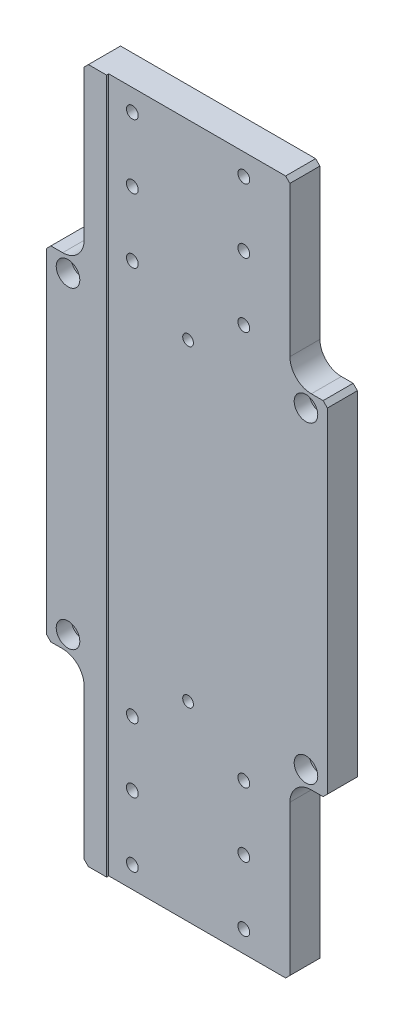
ISO-10303-21;
HEADER;
FILE_DESCRIPTION(('STEP AP214'),'2;1');
FILE_NAME('part.step','',(''),(''),'','','');
FILE_SCHEMA(('AUTOMOTIVE_DESIGN { 1 0 10303 214 1 1 1 1 }'));
ENDSEC;
DATA;
#1=APPLICATION_CONTEXT('core data for automotive mechanical design processes');
#2=APPLICATION_PROTOCOL_DEFINITION('international standard','automotive_design',2000,#1);
#3=PRODUCT_CONTEXT('',#1,'mechanical');
#4=PRODUCT('Part','Part','',(#3));
#5=PRODUCT_RELATED_PRODUCT_CATEGORY('part','',(#4));
#6=PRODUCT_DEFINITION_FORMATION('','',#4);
#7=PRODUCT_DEFINITION_CONTEXT('part definition',#1,'design');
#8=PRODUCT_DEFINITION('design','',#6,#7);
#9=PRODUCT_DEFINITION_SHAPE('','',#8);
#10=(LENGTH_UNIT() NAMED_UNIT(*) SI_UNIT(.MILLI.,.METRE.));
#11=(NAMED_UNIT(*) PLANE_ANGLE_UNIT() SI_UNIT($,.RADIAN.));
#12=(NAMED_UNIT(*) SI_UNIT($,.STERADIAN.) SOLID_ANGLE_UNIT());
#13=UNCERTAINTY_MEASURE_WITH_UNIT(LENGTH_MEASURE(1.E-05),#10,'distance_accuracy_value','');
#14=(GEOMETRIC_REPRESENTATION_CONTEXT(3) GLOBAL_UNCERTAINTY_ASSIGNED_CONTEXT((#13)) GLOBAL_UNIT_ASSIGNED_CONTEXT((#10,
#11,#12)) REPRESENTATION_CONTEXT('',''));
#15=CARTESIAN_POINT('',(0.,0.,0.));
#16=DIRECTION('',(0.,0.,1.));
#17=DIRECTION('',(1.,0.,0.));
#18=AXIS2_PLACEMENT_3D('',#15,#16,#17);
#19=CARTESIAN_POINT('',(47.5,-80.,7.5));
#20=DIRECTION('',(-1.,0.,0.));
#21=DIRECTION('',(0.,-1.,0.));
#22=AXIS2_PLACEMENT_3D('',#19,#20,#21);
#23=PLANE('',#22);
#24=DIRECTION('',(0.,1.,0.));
#25=VECTOR('',#24,1.);
#26=CARTESIAN_POINT('',(47.5,-80.,6.5));
#27=LINE('',#26,#25);
#28=CARTESIAN_POINT('',(47.5,-160.,6.5));
#29=VERTEX_POINT('',#28);
#30=CARTESIAN_POINT('',(47.5,-90.,6.5));
#31=VERTEX_POINT('',#30);
#32=EDGE_CURVE('E244',#29,#31,#27,.T.);
#33=ORIENTED_EDGE('',*,*,#32,.F.);
#34=DIRECTION('',(0.,0.,-1.));
#35=VECTOR('',#34,1.);
#36=CARTESIAN_POINT('',(47.5,-160.,7.5));
#37=LINE('',#36,#35);
#38=CARTESIAN_POINT('',(47.5,-160.,-7.5));
#39=VERTEX_POINT('',#38);
#40=EDGE_CURVE('E420',#29,#39,#37,.T.);
#41=ORIENTED_EDGE('',*,*,#40,.T.);
#42=DIRECTION('',(0.,1.,0.));
#43=VECTOR('',#42,1.);
#44=CARTESIAN_POINT('',(47.5,-80.,-7.5));
#45=LINE('',#44,#43);
#46=CARTESIAN_POINT('',(47.5,-90.,-7.5));
#47=VERTEX_POINT('',#46);
#48=EDGE_CURVE('E276',#39,#47,#45,.T.);
#49=ORIENTED_EDGE('',*,*,#48,.T.);
#50=DIRECTION('',(0.,0.,-1.));
#51=VECTOR('',#50,1.);
#52=CARTESIAN_POINT('',(47.5,-90.,6.5));
#53=LINE('',#52,#51);
#54=EDGE_CURVE('E334',#47,#31,#53,.F.);
#55=ORIENTED_EDGE('',*,*,#54,.T.);
#56=EDGE_LOOP('',(#33,#41,#49,#55));
#57=FACE_BOUND('',#56,.T.);
#58=ADVANCED_FACE('F33',(#57),#23,.F.);
#59=CARTESIAN_POINT('',(47.5,-80.,7.5));
#60=DIRECTION('',(0.,1.,0.));
#61=DIRECTION('',(-1.,0.,0.));
#62=AXIS2_PLACEMENT_3D('',#59,#60,#61);
#63=PLANE('',#62);
#64=DIRECTION('',(1.,0.,0.));
#65=VECTOR('',#64,1.);
#66=CARTESIAN_POINT('',(47.5,-80.,-7.5));
#67=LINE('',#66,#65);
#68=CARTESIAN_POINT('',(57.5,-80.,-7.5));
#69=VERTEX_POINT('',#68);
#70=CARTESIAN_POINT('',(63.,-80.,-7.5));
#71=VERTEX_POINT('',#70);
#72=EDGE_CURVE('E278',#69,#71,#67,.T.);
#73=ORIENTED_EDGE('',*,*,#72,.T.);
#74=DIRECTION('',(0.,0.,1.));
#75=VECTOR('',#74,1.);
#76=CARTESIAN_POINT('',(63.,-80.,7.5));
#77=LINE('',#76,#75);
#78=CARTESIAN_POINT('',(63.,-80.,6.5));
#79=VERTEX_POINT('',#78);
#80=EDGE_CURVE('E418',#71,#79,#77,.T.);
#81=ORIENTED_EDGE('',*,*,#80,.T.);
#82=DIRECTION('',(1.,0.,0.));
#83=VECTOR('',#82,1.);
#84=CARTESIAN_POINT('',(47.5,-80.,6.5));
#85=LINE('',#84,#83);
#86=CARTESIAN_POINT('',(57.5,-80.,6.5));
#87=VERTEX_POINT('',#86);
#88=EDGE_CURVE('E241',#87,#79,#85,.T.);
#89=ORIENTED_EDGE('',*,*,#88,.F.);
#90=DIRECTION('',(0.,0.,-1.));
#91=VECTOR('',#90,1.);
#92=CARTESIAN_POINT('',(57.5,-80.,-7.5));
#93=LINE('',#92,#91);
#94=EDGE_CURVE('E331',#87,#69,#93,.T.);
#95=ORIENTED_EDGE('',*,*,#94,.T.);
#96=EDGE_LOOP('',(#73,#81,#89,#95));
#97=FACE_BOUND('',#96,.T.);
#98=ADVANCED_FACE('F463',(#97),#63,.F.);
#99=CARTESIAN_POINT('',(65.,80.,7.5));
#100=DIRECTION('',(-1.,0.,0.));
#101=DIRECTION('',(0.,0.,1.));
#102=AXIS2_PLACEMENT_3D('',#99,#100,#101);
#103=PLANE('',#102);
#104=DIRECTION('',(0.,1.,0.));
#105=VECTOR('',#104,1.);
#106=CARTESIAN_POINT('',(65.,80.,-7.5));
#107=LINE('',#106,#105);
#108=CARTESIAN_POINT('',(65.,-78.0000000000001,-7.5));
#109=VERTEX_POINT('',#108);
#110=CARTESIAN_POINT('',(65.,77.9999999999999,-7.5));
#111=VERTEX_POINT('',#110);
#112=EDGE_CURVE('E281',#109,#111,#107,.T.);
#113=ORIENTED_EDGE('',*,*,#112,.T.);
#114=DIRECTION('',(0.,0.,1.));
#115=VECTOR('',#114,1.);
#116=CARTESIAN_POINT('',(65.,77.9999999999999,7.5));
#117=LINE('',#116,#115);
#118=CARTESIAN_POINT('',(65.,77.9999999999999,6.5));
#119=VERTEX_POINT('',#118);
#120=EDGE_CURVE('E416',#111,#119,#117,.T.);
#121=ORIENTED_EDGE('',*,*,#120,.T.);
#122=DIRECTION('',(0.,1.,0.));
#123=VECTOR('',#122,1.);
#124=CARTESIAN_POINT('',(65.,162.,6.5));
#125=LINE('',#124,#123);
#126=CARTESIAN_POINT('',(65.,-78.0000000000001,6.5));
#127=VERTEX_POINT('',#126);
#128=EDGE_CURVE('E228',#127,#119,#125,.T.);
#129=ORIENTED_EDGE('',*,*,#128,.F.);
#130=DIRECTION('',(0.,0.,-1.));
#131=VECTOR('',#130,1.);
#132=CARTESIAN_POINT('',(65.,-78.0000000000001,7.5));
#133=LINE('',#132,#131);
#134=EDGE_CURVE('E413',#127,#109,#133,.T.);
#135=ORIENTED_EDGE('',*,*,#134,.T.);
#136=EDGE_LOOP('',(#113,#121,#129,#135));
#137=FACE_BOUND('',#136,.T.);
#138=ADVANCED_FACE('F473',(#137),#103,.F.);
#139=CARTESIAN_POINT('',(47.5,80.,7.5));
#140=DIRECTION('',(0.,-1.,0.));
#141=DIRECTION('',(0.,0.,-1.));
#142=AXIS2_PLACEMENT_3D('',#139,#140,#141);
#143=PLANE('',#142);
#144=DIRECTION('',(-1.,0.,0.));
#145=VECTOR('',#144,1.);
#146=CARTESIAN_POINT('',(47.5,80.,6.5));
#147=LINE('',#146,#145);
#148=CARTESIAN_POINT('',(63.,80.,6.5));
#149=VERTEX_POINT('',#148);
#150=CARTESIAN_POINT('',(57.5,80.,6.5));
#151=VERTEX_POINT('',#150);
#152=EDGE_CURVE('E239',#149,#151,#147,.T.);
#153=ORIENTED_EDGE('',*,*,#152,.F.);
#154=DIRECTION('',(0.,0.,-1.));
#155=VECTOR('',#154,1.);
#156=CARTESIAN_POINT('',(63.,80.,7.5));
#157=LINE('',#156,#155);
#158=CARTESIAN_POINT('',(63.,80.,-7.5));
#159=VERTEX_POINT('',#158);
#160=EDGE_CURVE('E410',#149,#159,#157,.T.);
#161=ORIENTED_EDGE('',*,*,#160,.T.);
#162=DIRECTION('',(-1.,0.,0.));
#163=VECTOR('',#162,1.);
#164=CARTESIAN_POINT('',(47.5,80.,-7.5));
#165=LINE('',#164,#163);
#166=CARTESIAN_POINT('',(57.5,80.,-7.5));
#167=VERTEX_POINT('',#166);
#168=EDGE_CURVE('E284',#159,#167,#165,.T.);
#169=ORIENTED_EDGE('',*,*,#168,.T.);
#170=DIRECTION('',(0.,0.,-1.));
#171=VECTOR('',#170,1.);
#172=CARTESIAN_POINT('',(57.5,80.,6.5));
#173=LINE('',#172,#171);
#174=EDGE_CURVE('E340',#167,#151,#173,.F.);
#175=ORIENTED_EDGE('',*,*,#174,.T.);
#176=EDGE_LOOP('',(#153,#161,#169,#175));
#177=FACE_BOUND('',#176,.T.);
#178=ADVANCED_FACE('F480',(#177),#143,.F.);
#179=CARTESIAN_POINT('',(47.5,162.,7.5));
#180=DIRECTION('',(-1.,0.,0.));
#181=DIRECTION('',(0.,-1.,0.));
#182=AXIS2_PLACEMENT_3D('',#179,#180,#181);
#183=PLANE('',#182);
#184=DIRECTION('',(0.,1.,0.));
#185=VECTOR('',#184,1.);
#186=CARTESIAN_POINT('',(47.5,162.,-7.5));
#187=LINE('',#186,#185);
#188=CARTESIAN_POINT('',(47.5,90.,-7.5));
#189=VERTEX_POINT('',#188);
#190=CARTESIAN_POINT('',(47.5,160.,-7.5));
#191=VERTEX_POINT('',#190);
#192=EDGE_CURVE('E286',#189,#191,#187,.T.);
#193=ORIENTED_EDGE('',*,*,#192,.T.);
#194=DIRECTION('',(0.,0.,1.));
#195=VECTOR('',#194,1.);
#196=CARTESIAN_POINT('',(47.5,160.,7.5));
#197=LINE('',#196,#195);
#198=CARTESIAN_POINT('',(47.5,160.,6.5));
#199=VERTEX_POINT('',#198);
#200=EDGE_CURVE('E401',#191,#199,#197,.T.);
#201=ORIENTED_EDGE('',*,*,#200,.T.);
#202=DIRECTION('',(0.,1.,0.));
#203=VECTOR('',#202,1.);
#204=CARTESIAN_POINT('',(47.5,162.,6.5));
#205=LINE('',#204,#203);
#206=CARTESIAN_POINT('',(47.5,90.,6.5));
#207=VERTEX_POINT('',#206);
#208=EDGE_CURVE('E236',#207,#199,#205,.T.);
#209=ORIENTED_EDGE('',*,*,#208,.F.);
#210=DIRECTION('',(0.,0.,-1.));
#211=VECTOR('',#210,1.);
#212=CARTESIAN_POINT('',(47.5,90.,-7.5));
#213=LINE('',#212,#211);
#214=EDGE_CURVE('E337',#207,#189,#213,.T.);
#215=ORIENTED_EDGE('',*,*,#214,.T.);
#216=EDGE_LOOP('',(#193,#201,#209,#215));
#217=FACE_BOUND('',#216,.T.);
#218=ADVANCED_FACE('F490',(#217),#183,.F.);
#219=CARTESIAN_POINT('',(-65.,80.,7.5));
#220=DIRECTION('',(1.,0.,0.));
#221=DIRECTION('',(0.,1.,0.));
#222=AXIS2_PLACEMENT_3D('',#219,#220,#221);
#223=PLANE('',#222);
#224=DIRECTION('',(0.,-1.,0.));
#225=VECTOR('',#224,1.);
#226=CARTESIAN_POINT('',(-65.,80.,7.5));
#227=LINE('',#226,#225);
#228=CARTESIAN_POINT('',(-65.,78.,7.5));
#229=VERTEX_POINT('',#228);
#230=CARTESIAN_POINT('',(-65.,-78.0000000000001,7.5));
#231=VERTEX_POINT('',#230);
#232=EDGE_CURVE('E247',#229,#231,#227,.T.);
#233=ORIENTED_EDGE('',*,*,#232,.F.);
#234=DIRECTION('',(0.,0.,-1.));
#235=VECTOR('',#234,1.);
#236=CARTESIAN_POINT('',(-65.,78.,7.5));
#237=LINE('',#236,#235);
#238=CARTESIAN_POINT('',(-65.,78.,-7.5));
#239=VERTEX_POINT('',#238);
#240=EDGE_CURVE('E429',#229,#239,#237,.T.);
#241=ORIENTED_EDGE('',*,*,#240,.T.);
#242=DIRECTION('',(0.,-1.,0.));
#243=VECTOR('',#242,1.);
#244=CARTESIAN_POINT('',(-65.,80.,-7.5));
#245=LINE('',#244,#243);
#246=CARTESIAN_POINT('',(-65.,-78.0000000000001,-7.5));
#247=VERTEX_POINT('',#246);
#248=EDGE_CURVE('E246',#239,#247,#245,.T.);
#249=ORIENTED_EDGE('',*,*,#248,.T.);
#250=DIRECTION('',(0.,0.,1.));
#251=VECTOR('',#250,1.);
#252=CARTESIAN_POINT('',(-65.,-78.0000000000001,7.5));
#253=LINE('',#252,#251);
#254=EDGE_CURVE('E427',#247,#231,#253,.T.);
#255=ORIENTED_EDGE('',*,*,#254,.T.);
#256=EDGE_LOOP('',(#233,#241,#249,#255));
#257=FACE_BOUND('',#256,.T.);
#258=ADVANCED_FACE('F524',(#257),#223,.F.);
#259=CARTESIAN_POINT('',(-65.,-80.,7.5));
#260=DIRECTION('',(0.,1.,0.));
#261=DIRECTION('',(-1.,0.,0.));
#262=AXIS2_PLACEMENT_3D('',#259,#260,#261);
#263=PLANE('',#262);
#264=DIRECTION('',(1.,0.,0.));
#265=VECTOR('',#264,1.);
#266=CARTESIAN_POINT('',(-65.,-80.,7.5));
#267=LINE('',#266,#265);
#268=CARTESIAN_POINT('',(-63.0000000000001,-80.,7.5));
#269=VERTEX_POINT('',#268);
#270=CARTESIAN_POINT('',(-57.5,-80.,7.5));
#271=VERTEX_POINT('',#270);
#272=EDGE_CURVE('E250',#269,#271,#267,.T.);
#273=ORIENTED_EDGE('',*,*,#272,.F.);
#274=DIRECTION('',(0.,0.,-1.));
#275=VECTOR('',#274,1.);
#276=CARTESIAN_POINT('',(-63.0000000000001,-80.,7.5));
#277=LINE('',#276,#275);
#278=CARTESIAN_POINT('',(-63.0000000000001,-80.,-7.5));
#279=VERTEX_POINT('',#278);
#280=EDGE_CURVE('E11',#269,#279,#277,.T.);
#281=ORIENTED_EDGE('',*,*,#280,.T.);
#282=DIRECTION('',(1.,0.,0.));
#283=VECTOR('',#282,1.);
#284=CARTESIAN_POINT('',(-65.,-80.,-7.5));
#285=LINE('',#284,#283);
#286=CARTESIAN_POINT('',(-57.5,-80.,-7.5));
#287=VERTEX_POINT('',#286);
#288=EDGE_CURVE('E269',#279,#287,#285,.T.);
#289=ORIENTED_EDGE('',*,*,#288,.T.);
#290=DIRECTION('',(0.,0.,-1.));
#291=VECTOR('',#290,1.);
#292=CARTESIAN_POINT('',(-57.5,-80.,7.5));
#293=LINE('',#292,#291);
#294=EDGE_CURVE('E328',#287,#271,#293,.F.);
#295=ORIENTED_EDGE('',*,*,#294,.T.);
#296=EDGE_LOOP('',(#273,#281,#289,#295));
#297=FACE_BOUND('',#296,.T.);
#298=ADVANCED_FACE('F531',(#297),#263,.F.);
#299=CARTESIAN_POINT('',(-47.5,-80.,7.5));
#300=DIRECTION('',(1.,0.,0.));
#301=DIRECTION('',(0.,1.,0.));
#302=AXIS2_PLACEMENT_3D('',#299,#300,#301);
#303=PLANE('',#302);
#304=DIRECTION('',(0.,-1.,0.));
#305=VECTOR('',#304,1.);
#306=CARTESIAN_POINT('',(-47.5,-80.,-7.5));
#307=LINE('',#306,#305);
#308=CARTESIAN_POINT('',(-47.5,-90.,-7.5));
#309=VERTEX_POINT('',#308);
#310=CARTESIAN_POINT('',(-47.5,-160.,-7.5));
#311=VERTEX_POINT('',#310);
#312=EDGE_CURVE('E271',#309,#311,#307,.T.);
#313=ORIENTED_EDGE('',*,*,#312,.T.);
#314=DIRECTION('',(0.,0.,1.));
#315=VECTOR('',#314,1.);
#316=CARTESIAN_POINT('',(-47.5,-160.,7.5));
#317=LINE('',#316,#315);
#318=CARTESIAN_POINT('',(-47.5,-160.,7.5));
#319=VERTEX_POINT('',#318);
#320=EDGE_CURVE('E41',#311,#319,#317,.T.);
#321=ORIENTED_EDGE('',*,*,#320,.T.);
#322=DIRECTION('',(0.,-1.,0.));
#323=VECTOR('',#322,1.);
#324=CARTESIAN_POINT('',(-47.5,-80.,7.5));
#325=LINE('',#324,#323);
#326=CARTESIAN_POINT('',(-47.5,-90.,7.5));
#327=VERTEX_POINT('',#326);
#328=EDGE_CURVE('E253',#327,#319,#325,.T.);
#329=ORIENTED_EDGE('',*,*,#328,.F.);
#330=DIRECTION('',(0.,0.,-1.));
#331=VECTOR('',#330,1.);
#332=CARTESIAN_POINT('',(-47.5,-90.,-7.5));
#333=LINE('',#332,#331);
#334=EDGE_CURVE('E266',#327,#309,#333,.T.);
#335=ORIENTED_EDGE('',*,*,#334,.T.);
#336=EDGE_LOOP('',(#313,#321,#329,#335));
#337=FACE_BOUND('',#336,.T.);
#338=ADVANCED_FACE('F436',(#337),#303,.F.);
#339=CARTESIAN_POINT('',(-47.5,-162.,7.5));
#340=DIRECTION('',(0.,1.,0.));
#341=DIRECTION('',(0.,0.,1.));
#342=AXIS2_PLACEMENT_3D('',#339,#340,#341);
#343=PLANE('',#342);
#344=DIRECTION('',(1.,0.,0.));
#345=VECTOR('',#344,1.);
#346=CARTESIAN_POINT('',(-47.5,-162.,-7.5));
#347=LINE('',#346,#345);
#348=CARTESIAN_POINT('',(-45.5000000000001,-162.,-7.5));
#349=VERTEX_POINT('',#348);
#350=CARTESIAN_POINT('',(45.5000000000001,-162.,-7.5));
#351=VERTEX_POINT('',#350);
#352=EDGE_CURVE('E274',#349,#351,#347,.T.);
#353=ORIENTED_EDGE('',*,*,#352,.T.);
#354=DIRECTION('',(0.,0.,1.));
#355=VECTOR('',#354,1.);
#356=CARTESIAN_POINT('',(45.5000000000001,-162.,7.5));
#357=LINE('',#356,#355);
#358=CARTESIAN_POINT('',(45.5000000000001,-162.,6.5));
#359=VERTEX_POINT('',#358);
#360=EDGE_CURVE('E48',#351,#359,#357,.T.);
#361=ORIENTED_EDGE('',*,*,#360,.T.);
#362=DIRECTION('',(1.,0.,0.));
#363=VECTOR('',#362,1.);
#364=CARTESIAN_POINT('',(-37.,-162.,6.5));
#365=LINE('',#364,#363);
#366=CARTESIAN_POINT('',(-37.,-162.,6.5));
#367=VERTEX_POINT('',#366);
#368=EDGE_CURVE('E223',#367,#359,#365,.T.);
#369=ORIENTED_EDGE('',*,*,#368,.F.);
#370=DIRECTION('',(0.,0.,1.));
#371=VECTOR('',#370,1.);
#372=CARTESIAN_POINT('',(-37.,-162.,6.5));
#373=LINE('',#372,#371);
#374=CARTESIAN_POINT('',(-37.,-162.,7.5));
#375=VERTEX_POINT('',#374);
#376=EDGE_CURVE('E210',#367,#375,#373,.T.);
#377=ORIENTED_EDGE('',*,*,#376,.T.);
#378=DIRECTION('',(1.,0.,0.));
#379=VECTOR('',#378,1.);
#380=CARTESIAN_POINT('',(-47.5,-162.,7.5));
#381=LINE('',#380,#379);
#382=CARTESIAN_POINT('',(-45.5000000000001,-162.,7.5));
#383=VERTEX_POINT('',#382);
#384=EDGE_CURVE('E256',#383,#375,#381,.T.);
#385=ORIENTED_EDGE('',*,*,#384,.F.);
#386=DIRECTION('',(0.,0.,-1.));
#387=VECTOR('',#386,1.);
#388=CARTESIAN_POINT('',(-45.5000000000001,-162.,7.5));
#389=LINE('',#388,#387);
#390=EDGE_CURVE('E423',#383,#349,#389,.T.);
#391=ORIENTED_EDGE('',*,*,#390,.T.);
#392=EDGE_LOOP('',(#353,#361,#369,#377,#385,#391));
#393=FACE_BOUND('',#392,.T.);
#394=ADVANCED_FACE('F227',(#393),#343,.F.);
#395=CARTESIAN_POINT('',(-47.5,162.,7.5));
#396=DIRECTION('',(0.,-1.,0.));
#397=DIRECTION('',(0.,0.,-1.));
#398=AXIS2_PLACEMENT_3D('',#395,#396,#397);
#399=PLANE('',#398);
#400=DIRECTION('',(-1.,0.,0.));
#401=VECTOR('',#400,1.);
#402=CARTESIAN_POINT('',(-47.5,162.,-7.5));
#403=LINE('',#402,#401);
#404=CARTESIAN_POINT('',(45.5,162.,-7.5));
#405=VERTEX_POINT('',#404);
#406=CARTESIAN_POINT('',(-45.5,162.,-7.5));
#407=VERTEX_POINT('',#406);
#408=EDGE_CURVE('E289',#405,#407,#403,.T.);
#409=ORIENTED_EDGE('',*,*,#408,.T.);
#410=DIRECTION('',(0.,0.,1.));
#411=VECTOR('',#410,1.);
#412=CARTESIAN_POINT('',(-45.5,162.,7.5));
#413=LINE('',#412,#411);
#414=CARTESIAN_POINT('',(-45.5,162.,7.5));
#415=VERTEX_POINT('',#414);
#416=EDGE_CURVE('E391',#407,#415,#413,.T.);
#417=ORIENTED_EDGE('',*,*,#416,.T.);
#418=DIRECTION('',(-1.,0.,0.));
#419=VECTOR('',#418,1.);
#420=CARTESIAN_POINT('',(-47.5,162.,7.5));
#421=LINE('',#420,#419);
#422=CARTESIAN_POINT('',(-37.0000000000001,162.,7.5));
#423=VERTEX_POINT('',#422);
#424=EDGE_CURVE('E258',#423,#415,#421,.T.);
#425=ORIENTED_EDGE('',*,*,#424,.F.);
#426=DIRECTION('',(0.,0.,1.));
#427=VECTOR('',#426,1.);
#428=CARTESIAN_POINT('',(-37.0000000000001,162.,6.5));
#429=LINE('',#428,#427);
#430=CARTESIAN_POINT('',(-37.0000000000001,162.,6.5));
#431=VERTEX_POINT('',#430);
#432=EDGE_CURVE('E218',#431,#423,#429,.T.);
#433=ORIENTED_EDGE('',*,*,#432,.F.);
#434=DIRECTION('',(-1.,0.,0.));
#435=VECTOR('',#434,1.);
#436=CARTESIAN_POINT('',(-37.0000000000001,162.,6.5));
#437=LINE('',#436,#435);
#438=CARTESIAN_POINT('',(45.5,162.,6.5));
#439=VERTEX_POINT('',#438);
#440=EDGE_CURVE('E219',#439,#431,#437,.T.);
#441=ORIENTED_EDGE('',*,*,#440,.F.);
#442=DIRECTION('',(0.,0.,-1.));
#443=VECTOR('',#442,1.);
#444=CARTESIAN_POINT('',(45.5,162.,7.5));
#445=LINE('',#444,#443);
#446=EDGE_CURVE('E388',#439,#405,#445,.T.);
#447=ORIENTED_EDGE('',*,*,#446,.T.);
#448=EDGE_LOOP('',(#409,#417,#425,#433,#441,#447));
#449=FACE_BOUND('',#448,.T.);
#450=ADVANCED_FACE('F496',(#449),#399,.F.);
#451=CARTESIAN_POINT('',(-47.5,162.,7.5));
#452=DIRECTION('',(1.,0.,0.));
#453=DIRECTION('',(0.,1.,0.));
#454=AXIS2_PLACEMENT_3D('',#451,#452,#453);
#455=PLANE('',#454);
#456=DIRECTION('',(0.,-1.,0.));
#457=VECTOR('',#456,1.);
#458=CARTESIAN_POINT('',(-47.5,162.,7.5));
#459=LINE('',#458,#457);
#460=CARTESIAN_POINT('',(-47.5,160.,7.5));
#461=VERTEX_POINT('',#460);
#462=CARTESIAN_POINT('',(-47.5,90.,7.5));
#463=VERTEX_POINT('',#462);
#464=EDGE_CURVE('E261',#461,#463,#459,.T.);
#465=ORIENTED_EDGE('',*,*,#464,.F.);
#466=DIRECTION('',(0.,0.,-1.));
#467=VECTOR('',#466,1.);
#468=CARTESIAN_POINT('',(-47.5,160.,7.5));
#469=LINE('',#468,#467);
#470=CARTESIAN_POINT('',(-47.5,160.,-7.5));
#471=VERTEX_POINT('',#470);
#472=EDGE_CURVE('E369',#461,#471,#469,.T.);
#473=ORIENTED_EDGE('',*,*,#472,.T.);
#474=DIRECTION('',(0.,-1.,0.));
#475=VECTOR('',#474,1.);
#476=CARTESIAN_POINT('',(-47.5,162.,-7.5));
#477=LINE('',#476,#475);
#478=CARTESIAN_POINT('',(-47.5,90.,-7.5));
#479=VERTEX_POINT('',#478);
#480=EDGE_CURVE('E292',#471,#479,#477,.T.);
#481=ORIENTED_EDGE('',*,*,#480,.T.);
#482=DIRECTION('',(0.,0.,-1.));
#483=VECTOR('',#482,1.);
#484=CARTESIAN_POINT('',(-47.5,90.,7.5));
#485=LINE('',#484,#483);
#486=EDGE_CURVE('E346',#479,#463,#485,.F.);
#487=ORIENTED_EDGE('',*,*,#486,.T.);
#488=EDGE_LOOP('',(#465,#473,#481,#487));
#489=FACE_BOUND('',#488,.T.);
#490=ADVANCED_FACE('F506',(#489),#455,.F.);
#491=CARTESIAN_POINT('',(-65.,80.,7.5));
#492=DIRECTION('',(0.,-1.,0.));
#493=DIRECTION('',(0.,0.,-1.));
#494=AXIS2_PLACEMENT_3D('',#491,#492,#493);
#495=PLANE('',#494);
#496=DIRECTION('',(-1.,0.,0.));
#497=VECTOR('',#496,1.);
#498=CARTESIAN_POINT('',(-65.,80.,-7.5));
#499=LINE('',#498,#497);
#500=CARTESIAN_POINT('',(-57.5,80.,-7.5));
#501=VERTEX_POINT('',#500);
#502=CARTESIAN_POINT('',(-63.0000000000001,80.,-7.5));
#503=VERTEX_POINT('',#502);
#504=EDGE_CURVE('E251',#501,#503,#499,.T.);
#505=ORIENTED_EDGE('',*,*,#504,.T.);
#506=DIRECTION('',(0.,0.,1.));
#507=VECTOR('',#506,1.);
#508=CARTESIAN_POINT('',(-63.0000000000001,80.,7.5));
#509=LINE('',#508,#507);
#510=CARTESIAN_POINT('',(-63.0000000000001,80.,7.5));
#511=VERTEX_POINT('',#510);
#512=EDGE_CURVE('E432',#503,#511,#509,.T.);
#513=ORIENTED_EDGE('',*,*,#512,.T.);
#514=DIRECTION('',(-1.,0.,0.));
#515=VECTOR('',#514,1.);
#516=CARTESIAN_POINT('',(-65.,80.,7.5));
#517=LINE('',#516,#515);
#518=CARTESIAN_POINT('',(-57.5,80.,7.5));
#519=VERTEX_POINT('',#518);
#520=EDGE_CURVE('E263',#519,#511,#517,.T.);
#521=ORIENTED_EDGE('',*,*,#520,.F.);
#522=DIRECTION('',(0.,0.,-1.));
#523=VECTOR('',#522,1.);
#524=CARTESIAN_POINT('',(-57.5,80.,-7.5));
#525=LINE('',#524,#523);
#526=EDGE_CURVE('E343',#519,#501,#525,.T.);
#527=ORIENTED_EDGE('',*,*,#526,.T.);
#528=EDGE_LOOP('',(#505,#513,#521,#527));
#529=FACE_BOUND('',#528,.T.);
#530=ADVANCED_FACE('F516',(#529),#495,.F.);
#531=CARTESIAN_POINT('',(0.,0.,7.5));
#532=DIRECTION('',(0.,0.,1.));
#533=DIRECTION('',(1.,0.,0.));
#534=AXIS2_PLACEMENT_3D('',#531,#532,#533);
#535=PLANE('',#534);
#536=CARTESIAN_POINT('',(-55.,73.,7.5));
#537=DIRECTION('',(0.,0.,1.));
#538=DIRECTION('',(1.,0.,0.));
#539=AXIS2_PLACEMENT_3D('',#536,#537,#538);
#540=CIRCLE('',#539,5.5);
#541=CARTESIAN_POINT('',(-49.5,73.,7.5));
#542=VERTEX_POINT('',#541);
#543=EDGE_CURVE('E1297',#542,#542,#540,.T.);
#544=ORIENTED_EDGE('',*,*,#543,.F.);
#545=EDGE_LOOP('',(#544));
#546=FACE_BOUND('',#545,.T.);
#547=CARTESIAN_POINT('',(-55.,-73.,7.5));
#548=DIRECTION('',(0.,0.,1.));
#549=DIRECTION('',(1.,0.,0.));
#550=AXIS2_PLACEMENT_3D('',#547,#548,#549);
#551=CIRCLE('',#550,5.5);
#552=CARTESIAN_POINT('',(-49.5,-73.,7.5));
#553=VERTEX_POINT('',#552);
#554=EDGE_CURVE('E1285',#553,#553,#551,.T.);
#555=ORIENTED_EDGE('',*,*,#554,.F.);
#556=EDGE_LOOP('',(#555));
#557=FACE_BOUND('',#556,.T.);
#558=ORIENTED_EDGE('',*,*,#424,.T.);
#559=DIRECTION('',(0.707106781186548,0.707106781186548,0.));
#560=VECTOR('',#559,1.);
#561=CARTESIAN_POINT('',(-103.75,103.75,7.5));
#562=LINE('',#561,#560);
#563=EDGE_CURVE('E399',#415,#461,#562,.F.);
#564=ORIENTED_EDGE('',*,*,#563,.T.);
#565=ORIENTED_EDGE('',*,*,#464,.T.);
#566=CARTESIAN_POINT('',(-57.5,90.,7.5));
#567=DIRECTION('',(0.,0.,1.));
#568=DIRECTION('',(1.,0.,0.));
#569=AXIS2_PLACEMENT_3D('',#566,#567,#568);
#570=CIRCLE('',#569,10.);
#571=EDGE_CURVE('E367',#463,#519,#570,.F.);
#572=ORIENTED_EDGE('',*,*,#571,.T.);
#573=ORIENTED_EDGE('',*,*,#520,.T.);
#574=DIRECTION('',(0.707106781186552,0.707106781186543,0.));
#575=VECTOR('',#574,1.);
#576=CARTESIAN_POINT('',(-71.4999999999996,71.5000000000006,7.5));
#577=LINE('',#576,#575);
#578=EDGE_CURVE('E397',#511,#229,#577,.F.);
#579=ORIENTED_EDGE('',*,*,#578,.T.);
#580=ORIENTED_EDGE('',*,*,#232,.T.);
#581=DIRECTION('',(-0.707106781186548,0.707106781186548,0.));
#582=VECTOR('',#581,1.);
#583=CARTESIAN_POINT('',(-71.5,-71.5,7.5));
#584=LINE('',#583,#582);
#585=EDGE_CURVE('E393',#231,#269,#584,.F.);
#586=ORIENTED_EDGE('',*,*,#585,.T.);
#587=ORIENTED_EDGE('',*,*,#272,.T.);
#588=CARTESIAN_POINT('',(-57.5,-90.,7.5));
#589=DIRECTION('',(0.,0.,1.));
#590=DIRECTION('',(1.,0.,0.));
#591=AXIS2_PLACEMENT_3D('',#588,#589,#590);
#592=CIRCLE('',#591,10.);
#593=EDGE_CURVE('E352',#271,#327,#592,.F.);
#594=ORIENTED_EDGE('',*,*,#593,.T.);
#595=ORIENTED_EDGE('',*,*,#328,.T.);
#596=DIRECTION('',(-0.707106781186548,0.707106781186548,0.));
#597=VECTOR('',#596,1.);
#598=CARTESIAN_POINT('',(-103.75,-103.75,7.5));
#599=LINE('',#598,#597);
#600=EDGE_CURVE('E395',#319,#383,#599,.F.);
#601=ORIENTED_EDGE('',*,*,#600,.T.);
#602=ORIENTED_EDGE('',*,*,#384,.T.);
#603=DIRECTION('',(0.,-1.,0.));
#604=VECTOR('',#603,1.);
#605=CARTESIAN_POINT('',(-37.0000000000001,162.,7.5));
#606=LINE('',#605,#604);
#607=EDGE_CURVE('E216',#423,#375,#606,.T.);
#608=ORIENTED_EDGE('',*,*,#607,.F.);
#609=EDGE_LOOP('',(#558,#564,#565,#572,#573,#579,#580,#586,#587,#594,#595,#601,#602,#608));
#610=FACE_BOUND('',#609,.T.);
#611=ADVANCED_FACE('F442',(#546,#557,#610),#535,.T.);
#612=CARTESIAN_POINT('',(0.,0.,-7.5));
#613=DIRECTION('',(0.,0.,1.));
#614=DIRECTION('',(1.,0.,0.));
#615=AXIS2_PLACEMENT_3D('',#612,#613,#614);
#616=PLANE('',#615);
#617=CARTESIAN_POINT('',(-26.,-92.,-7.5));
#618=DIRECTION('',(0.,0.,-1.));
#619=DIRECTION('',(-1.,0.,0.));
#620=AXIS2_PLACEMENT_3D('',#617,#618,#619);
#621=CIRCLE('',#620,4.75);
#622=CARTESIAN_POINT('',(-30.75,-92.,-7.5));
#623=VERTEX_POINT('',#622);
#624=EDGE_CURVE('E1435',#623,#623,#621,.T.);
#625=ORIENTED_EDGE('',*,*,#624,.F.);
#626=EDGE_LOOP('',(#625));
#627=FACE_BOUND('',#626,.T.);
#628=CARTESIAN_POINT('',(26.,-122.,-7.5));
#629=DIRECTION('',(0.,0.,-1.));
#630=DIRECTION('',(-1.,0.,0.));
#631=AXIS2_PLACEMENT_3D('',#628,#629,#630);
#632=CIRCLE('',#631,4.75);
#633=CARTESIAN_POINT('',(21.25,-122.,-7.5));
#634=VERTEX_POINT('',#633);
#635=EDGE_CURVE('E1423',#634,#634,#632,.T.);
#636=ORIENTED_EDGE('',*,*,#635,.F.);
#637=EDGE_LOOP('',(#636));
#638=FACE_BOUND('',#637,.T.);
#639=CARTESIAN_POINT('',(-26.,-122.,-7.5));
#640=DIRECTION('',(0.,0.,-1.));
#641=DIRECTION('',(-1.,0.,0.));
#642=AXIS2_PLACEMENT_3D('',#639,#640,#641);
#643=CIRCLE('',#642,4.75);
#644=CARTESIAN_POINT('',(-30.75,-122.,-7.5));
#645=VERTEX_POINT('',#644);
#646=EDGE_CURVE('E1411',#645,#645,#643,.T.);
#647=ORIENTED_EDGE('',*,*,#646,.F.);
#648=EDGE_LOOP('',(#647));
#649=FACE_BOUND('',#648,.T.);
#650=CARTESIAN_POINT('',(26.,-152.,-7.5));
#651=DIRECTION('',(0.,0.,-1.));
#652=DIRECTION('',(-1.,0.,0.));
#653=AXIS2_PLACEMENT_3D('',#650,#651,#652);
#654=CIRCLE('',#653,4.75);
#655=CARTESIAN_POINT('',(21.25,-152.,-7.5));
#656=VERTEX_POINT('',#655);
#657=EDGE_CURVE('E1399',#656,#656,#654,.T.);
#658=ORIENTED_EDGE('',*,*,#657,.F.);
#659=EDGE_LOOP('',(#658));
#660=FACE_BOUND('',#659,.T.);
#661=CARTESIAN_POINT('',(-26.,-152.,-7.5));
#662=DIRECTION('',(0.,0.,-1.));
#663=DIRECTION('',(-1.,0.,0.));
#664=AXIS2_PLACEMENT_3D('',#661,#662,#663);
#665=CIRCLE('',#664,4.75);
#666=CARTESIAN_POINT('',(-30.75,-152.,-7.5));
#667=VERTEX_POINT('',#666);
#668=EDGE_CURVE('E1387',#667,#667,#665,.T.);
#669=ORIENTED_EDGE('',*,*,#668,.F.);
#670=EDGE_LOOP('',(#669));
#671=FACE_BOUND('',#670,.T.);
#672=CARTESIAN_POINT('',(26.,-92.,-7.5));
#673=DIRECTION('',(0.,0.,-1.));
#674=DIRECTION('',(-1.,0.,0.));
#675=AXIS2_PLACEMENT_3D('',#672,#673,#674);
#676=CIRCLE('',#675,4.75);
#677=CARTESIAN_POINT('',(21.25,-92.,-7.5));
#678=VERTEX_POINT('',#677);
#679=EDGE_CURVE('E1375',#678,#678,#676,.T.);
#680=ORIENTED_EDGE('',*,*,#679,.F.);
#681=EDGE_LOOP('',(#680));
#682=FACE_BOUND('',#681,.T.);
#683=CARTESIAN_POINT('',(26.,152.,-7.5));
#684=DIRECTION('',(0.,0.,-1.));
#685=DIRECTION('',(-1.,0.,0.));
#686=AXIS2_PLACEMENT_3D('',#683,#684,#685);
#687=CIRCLE('',#686,4.75);
#688=CARTESIAN_POINT('',(21.25,152.,-7.5));
#689=VERTEX_POINT('',#688);
#690=EDGE_CURVE('E1363',#689,#689,#687,.T.);
#691=ORIENTED_EDGE('',*,*,#690,.F.);
#692=EDGE_LOOP('',(#691));
#693=FACE_BOUND('',#692,.T.);
#694=CARTESIAN_POINT('',(-26.,152.,-7.5));
#695=DIRECTION('',(0.,0.,-1.));
#696=DIRECTION('',(-1.,0.,0.));
#697=AXIS2_PLACEMENT_3D('',#694,#695,#696);
#698=CIRCLE('',#697,4.75);
#699=CARTESIAN_POINT('',(-30.75,152.,-7.5));
#700=VERTEX_POINT('',#699);
#701=EDGE_CURVE('E324',#700,#700,#698,.T.);
#702=ORIENTED_EDGE('',*,*,#701,.F.);
#703=EDGE_LOOP('',(#702));
#704=FACE_BOUND('',#703,.T.);
#705=CARTESIAN_POINT('',(26.,122.,-7.5));
#706=DIRECTION('',(0.,0.,-1.));
#707=DIRECTION('',(-1.,0.,0.));
#708=AXIS2_PLACEMENT_3D('',#705,#706,#707);
#709=CIRCLE('',#708,4.75);
#710=CARTESIAN_POINT('',(21.25,122.,-7.5));
#711=VERTEX_POINT('',#710);
#712=EDGE_CURVE('E319',#711,#711,#709,.T.);
#713=ORIENTED_EDGE('',*,*,#712,.F.);
#714=EDGE_LOOP('',(#713));
#715=FACE_BOUND('',#714,.T.);
#716=CARTESIAN_POINT('',(-26.,122.,-7.5));
#717=DIRECTION('',(0.,0.,-1.));
#718=DIRECTION('',(-1.,0.,0.));
#719=AXIS2_PLACEMENT_3D('',#716,#717,#718);
#720=CIRCLE('',#719,4.75);
#721=CARTESIAN_POINT('',(-30.75,122.,-7.5));
#722=VERTEX_POINT('',#721);
#723=EDGE_CURVE('E314',#722,#722,#720,.T.);
#724=ORIENTED_EDGE('',*,*,#723,.F.);
#725=EDGE_LOOP('',(#724));
#726=FACE_BOUND('',#725,.T.);
#727=CARTESIAN_POINT('',(26.,92.,-7.5));
#728=DIRECTION('',(0.,0.,-1.));
#729=DIRECTION('',(-1.,0.,0.));
#730=AXIS2_PLACEMENT_3D('',#727,#728,#729);
#731=CIRCLE('',#730,4.75);
#732=CARTESIAN_POINT('',(21.25,92.,-7.5));
#733=VERTEX_POINT('',#732);
#734=EDGE_CURVE('E309',#733,#733,#731,.T.);
#735=ORIENTED_EDGE('',*,*,#734,.F.);
#736=EDGE_LOOP('',(#735));
#737=FACE_BOUND('',#736,.T.);
#738=CARTESIAN_POINT('',(-26.,92.,-7.5));
#739=DIRECTION('',(0.,0.,-1.));
#740=DIRECTION('',(-1.,0.,0.));
#741=AXIS2_PLACEMENT_3D('',#738,#739,#740);
#742=CIRCLE('',#741,4.75);
#743=CARTESIAN_POINT('',(-30.75,92.,-7.5));
#744=VERTEX_POINT('',#743);
#745=EDGE_CURVE('E304',#744,#744,#742,.T.);
#746=ORIENTED_EDGE('',*,*,#745,.F.);
#747=EDGE_LOOP('',(#746));
#748=FACE_BOUND('',#747,.T.);
#749=CARTESIAN_POINT('',(55.,73.,-7.5));
#750=DIRECTION('',(0.,0.,1.));
#751=DIRECTION('',(1.,0.,0.));
#752=AXIS2_PLACEMENT_3D('',#749,#750,#751);
#753=CIRCLE('',#752,3.3);
#754=CARTESIAN_POINT('',(58.3,73.,-7.5));
#755=VERTEX_POINT('',#754);
#756=EDGE_CURVE('E1312',#755,#755,#753,.T.);
#757=ORIENTED_EDGE('',*,*,#756,.T.);
#758=EDGE_LOOP('',(#757));
#759=FACE_BOUND('',#758,.T.);
#760=CARTESIAN_POINT('',(55.,-73.,-7.5));
#761=DIRECTION('',(0.,0.,1.));
#762=DIRECTION('',(1.,0.,0.));
#763=AXIS2_PLACEMENT_3D('',#760,#761,#762);
#764=CIRCLE('',#763,3.3);
#765=CARTESIAN_POINT('',(58.3,-73.,-7.5));
#766=VERTEX_POINT('',#765);
#767=EDGE_CURVE('E1300',#766,#766,#764,.T.);
#768=ORIENTED_EDGE('',*,*,#767,.T.);
#769=EDGE_LOOP('',(#768));
#770=FACE_BOUND('',#769,.T.);
#771=CARTESIAN_POINT('',(-55.,73.,-7.5));
#772=DIRECTION('',(0.,0.,1.));
#773=DIRECTION('',(1.,0.,0.));
#774=AXIS2_PLACEMENT_3D('',#771,#772,#773);
#775=CIRCLE('',#774,3.3);
#776=CARTESIAN_POINT('',(-51.7,73.,-7.5));
#777=VERTEX_POINT('',#776);
#778=EDGE_CURVE('E1288',#777,#777,#775,.T.);
#779=ORIENTED_EDGE('',*,*,#778,.T.);
#780=EDGE_LOOP('',(#779));
#781=FACE_BOUND('',#780,.T.);
#782=CARTESIAN_POINT('',(-55.,-73.,-7.5));
#783=DIRECTION('',(0.,0.,1.));
#784=DIRECTION('',(1.,0.,0.));
#785=AXIS2_PLACEMENT_3D('',#782,#783,#784);
#786=CIRCLE('',#785,3.3);
#787=CARTESIAN_POINT('',(-51.7,-73.,-7.5));
#788=VERTEX_POINT('',#787);
#789=EDGE_CURVE('E1276',#788,#788,#786,.T.);
#790=ORIENTED_EDGE('',*,*,#789,.T.);
#791=EDGE_LOOP('',(#790));
#792=FACE_BOUND('',#791,.T.);
#793=CARTESIAN_POINT('',(0.,73.,-7.5));
#794=DIRECTION('',(0.,0.,1.));
#795=DIRECTION('',(1.,0.,0.));
#796=AXIS2_PLACEMENT_3D('',#793,#794,#795);
#797=CIRCLE('',#796,2.5);
#798=CARTESIAN_POINT('',(2.5,73.,-7.5));
#799=VERTEX_POINT('',#798);
#800=EDGE_CURVE('E1268',#799,#799,#797,.T.);
#801=ORIENTED_EDGE('',*,*,#800,.T.);
#802=EDGE_LOOP('',(#801));
#803=FACE_BOUND('',#802,.T.);
#804=CARTESIAN_POINT('',(0.,-73.,-7.5));
#805=DIRECTION('',(0.,0.,1.));
#806=DIRECTION('',(1.,0.,0.));
#807=AXIS2_PLACEMENT_3D('',#804,#805,#806);
#808=CIRCLE('',#807,2.5);
#809=CARTESIAN_POINT('',(2.5,-73.,-7.5));
#810=VERTEX_POINT('',#809);
#811=EDGE_CURVE('E235',#810,#810,#808,.T.);
#812=ORIENTED_EDGE('',*,*,#811,.T.);
#813=EDGE_LOOP('',(#812));
#814=FACE_BOUND('',#813,.T.);
#815=ORIENTED_EDGE('',*,*,#480,.F.);
#816=DIRECTION('',(-0.707106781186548,-0.707106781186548,0.));
#817=VECTOR('',#816,1.);
#818=CARTESIAN_POINT('',(-47.5,160.,-7.5));
#819=LINE('',#818,#817);
#820=EDGE_CURVE('E386',#471,#407,#819,.F.);
#821=ORIENTED_EDGE('',*,*,#820,.T.);
#822=ORIENTED_EDGE('',*,*,#408,.F.);
#823=DIRECTION('',(-0.707106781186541,0.707106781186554,0.));
#824=VECTOR('',#823,1.);
#825=CARTESIAN_POINT('',(45.5,162.,-7.5));
#826=LINE('',#825,#824);
#827=EDGE_CURVE('E384',#405,#191,#826,.F.);
#828=ORIENTED_EDGE('',*,*,#827,.T.);
#829=ORIENTED_EDGE('',*,*,#192,.F.);
#830=CARTESIAN_POINT('',(57.5,90.,-7.5));
#831=DIRECTION('',(0.,0.,1.));
#832=DIRECTION('',(1.,0.,0.));
#833=AXIS2_PLACEMENT_3D('',#830,#831,#832);
#834=CIRCLE('',#833,10.);
#835=EDGE_CURVE('E359',#189,#167,#834,.T.);
#836=ORIENTED_EDGE('',*,*,#835,.T.);
#837=ORIENTED_EDGE('',*,*,#168,.F.);
#838=DIRECTION('',(-0.707106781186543,0.707106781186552,0.));
#839=VECTOR('',#838,1.);
#840=CARTESIAN_POINT('',(63.,80.,-7.5));
#841=LINE('',#840,#839);
#842=EDGE_CURVE('E382',#159,#111,#841,.F.);
#843=ORIENTED_EDGE('',*,*,#842,.T.);
#844=ORIENTED_EDGE('',*,*,#112,.F.);
#845=DIRECTION('',(0.707106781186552,0.707106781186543,0.));
#846=VECTOR('',#845,1.);
#847=CARTESIAN_POINT('',(65.,-78.0000000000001,-7.5));
#848=LINE('',#847,#846);
#849=EDGE_CURVE('E380',#109,#71,#848,.F.);
#850=ORIENTED_EDGE('',*,*,#849,.T.);
#851=ORIENTED_EDGE('',*,*,#72,.F.);
#852=CARTESIAN_POINT('',(57.5,-90.,-7.5));
#853=DIRECTION('',(0.,0.,1.));
#854=DIRECTION('',(1.,0.,0.));
#855=AXIS2_PLACEMENT_3D('',#852,#853,#854);
#856=CIRCLE('',#855,10.);
#857=EDGE_CURVE('E354',#69,#47,#856,.T.);
#858=ORIENTED_EDGE('',*,*,#857,.T.);
#859=ORIENTED_EDGE('',*,*,#48,.F.);
#860=DIRECTION('',(0.707106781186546,0.707106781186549,0.));
#861=VECTOR('',#860,1.);
#862=CARTESIAN_POINT('',(47.5,-160.,-7.5));
#863=LINE('',#862,#861);
#864=EDGE_CURVE('E378',#39,#351,#863,.F.);
#865=ORIENTED_EDGE('',*,*,#864,.T.);
#866=ORIENTED_EDGE('',*,*,#352,.F.);
#867=DIRECTION('',(0.707106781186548,-0.707106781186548,0.));
#868=VECTOR('',#867,1.);
#869=CARTESIAN_POINT('',(-45.5000000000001,-162.,-7.5));
#870=LINE('',#869,#868);
#871=EDGE_CURVE('E374',#349,#311,#870,.F.);
#872=ORIENTED_EDGE('',*,*,#871,.T.);
#873=ORIENTED_EDGE('',*,*,#312,.F.);
#874=CARTESIAN_POINT('',(-57.5,-90.,-7.5));
#875=DIRECTION('',(0.,0.,1.));
#876=DIRECTION('',(1.,0.,0.));
#877=AXIS2_PLACEMENT_3D('',#874,#875,#876);
#878=CIRCLE('',#877,10.);
#879=EDGE_CURVE('E349',#309,#287,#878,.T.);
#880=ORIENTED_EDGE('',*,*,#879,.T.);
#881=ORIENTED_EDGE('',*,*,#288,.F.);
#882=DIRECTION('',(0.707106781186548,-0.707106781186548,0.));
#883=VECTOR('',#882,1.);
#884=CARTESIAN_POINT('',(-63.0000000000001,-80.,-7.5));
#885=LINE('',#884,#883);
#886=EDGE_CURVE('E372',#279,#247,#885,.F.);
#887=ORIENTED_EDGE('',*,*,#886,.T.);
#888=ORIENTED_EDGE('',*,*,#248,.F.);
#889=DIRECTION('',(-0.707106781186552,-0.707106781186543,0.));
#890=VECTOR('',#889,1.);
#891=CARTESIAN_POINT('',(-65.,78.,-7.5));
#892=LINE('',#891,#890);
#893=EDGE_CURVE('E376',#239,#503,#892,.F.);
#894=ORIENTED_EDGE('',*,*,#893,.T.);
#895=ORIENTED_EDGE('',*,*,#504,.F.);
#896=CARTESIAN_POINT('',(-57.5,90.,-7.5));
#897=DIRECTION('',(0.,0.,1.));
#898=DIRECTION('',(1.,0.,0.));
#899=AXIS2_PLACEMENT_3D('',#896,#897,#898);
#900=CIRCLE('',#899,10.);
#901=EDGE_CURVE('E364',#501,#479,#900,.T.);
#902=ORIENTED_EDGE('',*,*,#901,.T.);
#903=EDGE_LOOP('',(#815,#821,#822,#828,#829,#836,#837,#843,#844,#850,#851,#858,#859,#865,#866,
#872,#873,#880,#881,#887,#888,#894,#895,#902));
#904=FACE_BOUND('',#903,.T.);
#905=ADVANCED_FACE('F449',(#627,#638,#649,#660,#671,#682,#693,#704,#715,#726,#737,#748,#759,
#770,#781,#792,#803,#814,#904),#616,.F.);
#906=CARTESIAN_POINT('',(0.,0.,6.5));
#907=DIRECTION('',(0.,0.,1.));
#908=DIRECTION('',(1.,0.,0.));
#909=AXIS2_PLACEMENT_3D('',#906,#907,#908);
#910=PLANE('',#909);
#911=CARTESIAN_POINT('',(-26.,-92.,6.5));
#912=DIRECTION('',(0.,0.,1.));
#913=DIRECTION('',(1.,0.,0.));
#914=AXIS2_PLACEMENT_3D('',#911,#912,#913);
#915=CIRCLE('',#914,2.75);
#916=CARTESIAN_POINT('',(-23.25,-92.,6.5));
#917=VERTEX_POINT('',#916);
#918=EDGE_CURVE('E1432',#917,#917,#915,.T.);
#919=ORIENTED_EDGE('',*,*,#918,.F.);
#920=EDGE_LOOP('',(#919));
#921=FACE_BOUND('',#920,.T.);
#922=CARTESIAN_POINT('',(26.,-122.,6.5));
#923=DIRECTION('',(0.,0.,1.));
#924=DIRECTION('',(1.,0.,0.));
#925=AXIS2_PLACEMENT_3D('',#922,#923,#924);
#926=CIRCLE('',#925,2.75);
#927=CARTESIAN_POINT('',(28.75,-122.,6.5));
#928=VERTEX_POINT('',#927);
#929=EDGE_CURVE('E1420',#928,#928,#926,.T.);
#930=ORIENTED_EDGE('',*,*,#929,.F.);
#931=EDGE_LOOP('',(#930));
#932=FACE_BOUND('',#931,.T.);
#933=CARTESIAN_POINT('',(-26.,-122.,6.5));
#934=DIRECTION('',(0.,0.,1.));
#935=DIRECTION('',(1.,0.,0.));
#936=AXIS2_PLACEMENT_3D('',#933,#934,#935);
#937=CIRCLE('',#936,2.75);
#938=CARTESIAN_POINT('',(-23.25,-122.,6.5));
#939=VERTEX_POINT('',#938);
#940=EDGE_CURVE('E1408',#939,#939,#937,.T.);
#941=ORIENTED_EDGE('',*,*,#940,.F.);
#942=EDGE_LOOP('',(#941));
#943=FACE_BOUND('',#942,.T.);
#944=CARTESIAN_POINT('',(26.,-152.,6.5));
#945=DIRECTION('',(0.,0.,1.));
#946=DIRECTION('',(1.,0.,0.));
#947=AXIS2_PLACEMENT_3D('',#944,#945,#946);
#948=CIRCLE('',#947,2.75);
#949=CARTESIAN_POINT('',(28.75,-152.,6.5));
#950=VERTEX_POINT('',#949);
#951=EDGE_CURVE('E1396',#950,#950,#948,.T.);
#952=ORIENTED_EDGE('',*,*,#951,.F.);
#953=EDGE_LOOP('',(#952));
#954=FACE_BOUND('',#953,.T.);
#955=CARTESIAN_POINT('',(-26.,-152.,6.5));
#956=DIRECTION('',(0.,0.,1.));
#957=DIRECTION('',(1.,0.,0.));
#958=AXIS2_PLACEMENT_3D('',#955,#956,#957);
#959=CIRCLE('',#958,2.75);
#960=CARTESIAN_POINT('',(-23.25,-152.,6.5));
#961=VERTEX_POINT('',#960);
#962=EDGE_CURVE('E1384',#961,#961,#959,.T.);
#963=ORIENTED_EDGE('',*,*,#962,.F.);
#964=EDGE_LOOP('',(#963));
#965=FACE_BOUND('',#964,.T.);
#966=CARTESIAN_POINT('',(26.,-92.,6.5));
#967=DIRECTION('',(0.,0.,1.));
#968=DIRECTION('',(1.,0.,0.));
#969=AXIS2_PLACEMENT_3D('',#966,#967,#968);
#970=CIRCLE('',#969,2.75);
#971=CARTESIAN_POINT('',(28.75,-92.,6.5));
#972=VERTEX_POINT('',#971);
#973=EDGE_CURVE('E1372',#972,#972,#970,.T.);
#974=ORIENTED_EDGE('',*,*,#973,.F.);
#975=EDGE_LOOP('',(#974));
#976=FACE_BOUND('',#975,.T.);
#977=CARTESIAN_POINT('',(26.,152.,6.5));
#978=DIRECTION('',(0.,0.,1.));
#979=DIRECTION('',(1.,0.,0.));
#980=AXIS2_PLACEMENT_3D('',#977,#978,#979);
#981=CIRCLE('',#980,2.75);
#982=CARTESIAN_POINT('',(28.75,152.,6.5));
#983=VERTEX_POINT('',#982);
#984=EDGE_CURVE('E321',#983,#983,#981,.T.);
#985=ORIENTED_EDGE('',*,*,#984,.F.);
#986=EDGE_LOOP('',(#985));
#987=FACE_BOUND('',#986,.T.);
#988=CARTESIAN_POINT('',(-26.,152.,6.5));
#989=DIRECTION('',(0.,0.,1.));
#990=DIRECTION('',(1.,0.,0.));
#991=AXIS2_PLACEMENT_3D('',#988,#989,#990);
#992=CIRCLE('',#991,2.75);
#993=CARTESIAN_POINT('',(-23.25,152.,6.5));
#994=VERTEX_POINT('',#993);
#995=EDGE_CURVE('E316',#994,#994,#992,.T.);
#996=ORIENTED_EDGE('',*,*,#995,.F.);
#997=EDGE_LOOP('',(#996));
#998=FACE_BOUND('',#997,.T.);
#999=CARTESIAN_POINT('',(26.,122.,6.5));
#1000=DIRECTION('',(0.,0.,1.));
#1001=DIRECTION('',(1.,0.,0.));
#1002=AXIS2_PLACEMENT_3D('',#999,#1000,#1001);
#1003=CIRCLE('',#1002,2.75);
#1004=CARTESIAN_POINT('',(28.75,122.,6.5));
#1005=VERTEX_POINT('',#1004);
#1006=EDGE_CURVE('E311',#1005,#1005,#1003,.T.);
#1007=ORIENTED_EDGE('',*,*,#1006,.F.);
#1008=EDGE_LOOP('',(#1007));
#1009=FACE_BOUND('',#1008,.T.);
#1010=CARTESIAN_POINT('',(-26.,122.,6.5));
#1011=DIRECTION('',(0.,0.,1.));
#1012=DIRECTION('',(1.,0.,0.));
#1013=AXIS2_PLACEMENT_3D('',#1010,#1011,#1012);
#1014=CIRCLE('',#1013,2.75);
#1015=CARTESIAN_POINT('',(-23.25,122.,6.5));
#1016=VERTEX_POINT('',#1015);
#1017=EDGE_CURVE('E306',#1016,#1016,#1014,.T.);
#1018=ORIENTED_EDGE('',*,*,#1017,.F.);
#1019=EDGE_LOOP('',(#1018));
#1020=FACE_BOUND('',#1019,.T.);
#1021=CARTESIAN_POINT('',(26.,92.,6.5));
#1022=DIRECTION('',(0.,0.,1.));
#1023=DIRECTION('',(1.,0.,0.));
#1024=AXIS2_PLACEMENT_3D('',#1021,#1022,#1023);
#1025=CIRCLE('',#1024,2.75);
#1026=CARTESIAN_POINT('',(28.75,92.,6.5));
#1027=VERTEX_POINT('',#1026);
#1028=EDGE_CURVE('E301',#1027,#1027,#1025,.T.);
#1029=ORIENTED_EDGE('',*,*,#1028,.F.);
#1030=EDGE_LOOP('',(#1029));
#1031=FACE_BOUND('',#1030,.T.);
#1032=CARTESIAN_POINT('',(-26.,92.,6.5));
#1033=DIRECTION('',(0.,0.,1.));
#1034=DIRECTION('',(1.,0.,0.));
#1035=AXIS2_PLACEMENT_3D('',#1032,#1033,#1034);
#1036=CIRCLE('',#1035,2.75);
#1037=CARTESIAN_POINT('',(-23.25,92.,6.5));
#1038=VERTEX_POINT('',#1037);
#1039=EDGE_CURVE('E296',#1038,#1038,#1036,.T.);
#1040=ORIENTED_EDGE('',*,*,#1039,.F.);
#1041=EDGE_LOOP('',(#1040));
#1042=FACE_BOUND('',#1041,.T.);
#1043=CARTESIAN_POINT('',(55.,73.,6.5));
#1044=DIRECTION('',(0.,0.,1.));
#1045=DIRECTION('',(1.,0.,0.));
#1046=AXIS2_PLACEMENT_3D('',#1043,#1044,#1045);
#1047=CIRCLE('',#1046,5.5);
#1048=CARTESIAN_POINT('',(60.5,73.,6.5));
#1049=VERTEX_POINT('',#1048);
#1050=EDGE_CURVE('E299',#1049,#1049,#1047,.T.);
#1051=ORIENTED_EDGE('',*,*,#1050,.F.);
#1052=EDGE_LOOP('',(#1051));
#1053=FACE_BOUND('',#1052,.T.);
#1054=CARTESIAN_POINT('',(55.,-73.,6.5));
#1055=DIRECTION('',(0.,0.,1.));
#1056=DIRECTION('',(1.,0.,0.));
#1057=AXIS2_PLACEMENT_3D('',#1054,#1055,#1056);
#1058=CIRCLE('',#1057,5.5);
#1059=CARTESIAN_POINT('',(60.5,-73.,6.5));
#1060=VERTEX_POINT('',#1059);
#1061=EDGE_CURVE('E1309',#1060,#1060,#1058,.T.);
#1062=ORIENTED_EDGE('',*,*,#1061,.F.);
#1063=EDGE_LOOP('',(#1062));
#1064=FACE_BOUND('',#1063,.T.);
#1065=CARTESIAN_POINT('',(0.,73.,6.5));
#1066=DIRECTION('',(0.,0.,1.));
#1067=DIRECTION('',(1.,0.,0.));
#1068=AXIS2_PLACEMENT_3D('',#1065,#1066,#1067);
#1069=CIRCLE('',#1068,2.49999999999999);
#1070=CARTESIAN_POINT('',(2.49999999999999,73.,6.5));
#1071=VERTEX_POINT('',#1070);
#1072=EDGE_CURVE('E1271',#1071,#1071,#1069,.T.);
#1073=ORIENTED_EDGE('',*,*,#1072,.F.);
#1074=EDGE_LOOP('',(#1073));
#1075=FACE_BOUND('',#1074,.T.);
#1076=CARTESIAN_POINT('',(0.,-73.,6.5));
#1077=DIRECTION('',(0.,0.,1.));
#1078=DIRECTION('',(1.,0.,0.));
#1079=AXIS2_PLACEMENT_3D('',#1076,#1077,#1078);
#1080=CIRCLE('',#1079,2.49999999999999);
#1081=CARTESIAN_POINT('',(2.49999999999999,-73.,6.5));
#1082=VERTEX_POINT('',#1081);
#1083=EDGE_CURVE('E1266',#1082,#1082,#1080,.T.);
#1084=ORIENTED_EDGE('',*,*,#1083,.F.);
#1085=EDGE_LOOP('',(#1084));
#1086=FACE_BOUND('',#1085,.T.);
#1087=ORIENTED_EDGE('',*,*,#208,.T.);
#1088=DIRECTION('',(0.707106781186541,-0.707106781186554,0.));
#1089=VECTOR('',#1088,1.);
#1090=CARTESIAN_POINT('',(103.75,103.749999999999,6.5));
#1091=LINE('',#1090,#1089);
#1092=EDGE_CURVE('E408',#199,#439,#1091,.F.);
#1093=ORIENTED_EDGE('',*,*,#1092,.T.);
#1094=ORIENTED_EDGE('',*,*,#440,.T.);
#1095=DIRECTION('',(0.,-1.,0.));
#1096=VECTOR('',#1095,1.);
#1097=CARTESIAN_POINT('',(-37.0000000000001,162.,6.5));
#1098=LINE('',#1097,#1096);
#1099=EDGE_CURVE('E213',#431,#367,#1098,.T.);
#1100=ORIENTED_EDGE('',*,*,#1099,.T.);
#1101=ORIENTED_EDGE('',*,*,#368,.T.);
#1102=DIRECTION('',(-0.707106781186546,-0.707106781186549,0.));
#1103=VECTOR('',#1102,1.);
#1104=CARTESIAN_POINT('',(103.75,-103.75,6.5));
#1105=LINE('',#1104,#1103);
#1106=EDGE_CURVE('E403',#359,#29,#1105,.F.);
#1107=ORIENTED_EDGE('',*,*,#1106,.T.);
#1108=ORIENTED_EDGE('',*,*,#32,.T.);
#1109=CARTESIAN_POINT('',(57.5,-90.,6.5));
#1110=DIRECTION('',(0.,0.,1.));
#1111=DIRECTION('',(1.,0.,0.));
#1112=AXIS2_PLACEMENT_3D('',#1109,#1110,#1111);
#1113=CIRCLE('',#1112,10.);
#1114=EDGE_CURVE('E357',#31,#87,#1113,.F.);
#1115=ORIENTED_EDGE('',*,*,#1114,.T.);
#1116=ORIENTED_EDGE('',*,*,#88,.T.);
#1117=DIRECTION('',(-0.707106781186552,-0.707106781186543,0.));
#1118=VECTOR('',#1117,1.);
#1119=CARTESIAN_POINT('',(71.4999999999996,-71.5000000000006,6.5));
#1120=LINE('',#1119,#1118);
#1121=EDGE_CURVE('E405',#79,#127,#1120,.F.);
#1122=ORIENTED_EDGE('',*,*,#1121,.T.);
#1123=ORIENTED_EDGE('',*,*,#128,.T.);
#1124=DIRECTION('',(0.707106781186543,-0.707106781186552,0.));
#1125=VECTOR('',#1124,1.);
#1126=CARTESIAN_POINT('',(71.5000000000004,71.4999999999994,6.5));
#1127=LINE('',#1126,#1125);
#1128=EDGE_CURVE('E56',#119,#149,#1127,.F.);
#1129=ORIENTED_EDGE('',*,*,#1128,.T.);
#1130=ORIENTED_EDGE('',*,*,#152,.T.);
#1131=CARTESIAN_POINT('',(57.5,90.,6.5));
#1132=DIRECTION('',(0.,0.,1.));
#1133=DIRECTION('',(1.,0.,0.));
#1134=AXIS2_PLACEMENT_3D('',#1131,#1132,#1133);
#1135=CIRCLE('',#1134,10.);
#1136=EDGE_CURVE('E362',#151,#207,#1135,.F.);
#1137=ORIENTED_EDGE('',*,*,#1136,.T.);
#1138=EDGE_LOOP('',(#1087,#1093,#1094,#1100,#1101,#1107,#1108,#1115,#1116,#1122,#1123,#1129,
#1130,#1137));
#1139=FACE_BOUND('',#1138,.T.);
#1140=ADVANCED_FACE('F222',(#921,#932,#943,#954,#965,#976,#987,#998,#1009,#1020,#1031,#1042,
#1053,#1064,#1075,#1086,#1139),#910,.T.);
#1141=CARTESIAN_POINT('',(-37.0000000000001,162.,6.5));
#1142=DIRECTION('',(-1.,0.,0.));
#1143=DIRECTION('',(0.,-1.,0.));
#1144=AXIS2_PLACEMENT_3D('',#1141,#1142,#1143);
#1145=PLANE('',#1144);
#1146=ORIENTED_EDGE('',*,*,#607,.T.);
#1147=ORIENTED_EDGE('',*,*,#376,.F.);
#1148=ORIENTED_EDGE('',*,*,#1099,.F.);
#1149=ORIENTED_EDGE('',*,*,#432,.T.);
#1150=EDGE_LOOP('',(#1146,#1147,#1148,#1149));
#1151=FACE_BOUND('',#1150,.T.);
#1152=ADVANCED_FACE('F212',(#1151),#1145,.F.);
#1153=CARTESIAN_POINT('',(0.,-73.,6.5));
#1154=DIRECTION('',(0.,0.,1.));
#1155=DIRECTION('',(1.,0.,0.));
#1156=AXIS2_PLACEMENT_3D('',#1153,#1154,#1155);
#1157=CYLINDRICAL_SURFACE('',#1156,2.49999999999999);
#1158=ORIENTED_EDGE('',*,*,#811,.F.);
#1159=EDGE_LOOP('',(#1158));
#1160=FACE_BOUND('',#1159,.T.);
#1161=ORIENTED_EDGE('',*,*,#1083,.T.);
#1162=EDGE_LOOP('',(#1161));
#1163=FACE_BOUND('',#1162,.T.);
#1164=ADVANCED_FACE('F1194',(#1160,#1163),#1157,.F.);
#1165=CARTESIAN_POINT('',(0.,73.,6.5));
#1166=DIRECTION('',(0.,0.,1.));
#1167=DIRECTION('',(1.,0.,0.));
#1168=AXIS2_PLACEMENT_3D('',#1165,#1166,#1167);
#1169=CYLINDRICAL_SURFACE('',#1168,2.49999999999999);
#1170=ORIENTED_EDGE('',*,*,#800,.F.);
#1171=EDGE_LOOP('',(#1170));
#1172=FACE_BOUND('',#1171,.T.);
#1173=ORIENTED_EDGE('',*,*,#1072,.T.);
#1174=EDGE_LOOP('',(#1173));
#1175=FACE_BOUND('',#1174,.T.);
#1176=ADVANCED_FACE('F1185',(#1172,#1175),#1169,.F.);
#1177=CARTESIAN_POINT('',(-55.,-73.,7.5));
#1178=DIRECTION('',(0.,0.,1.));
#1179=DIRECTION('',(1.,0.,0.));
#1180=AXIS2_PLACEMENT_3D('',#1177,#1178,#1179);
#1181=CYLINDRICAL_SURFACE('',#1180,3.3);
#1182=ORIENTED_EDGE('',*,*,#789,.F.);
#1183=EDGE_LOOP('',(#1182));
#1184=FACE_BOUND('',#1183,.T.);
#1185=CARTESIAN_POINT('',(-55.,-73.,0.5));
#1186=DIRECTION('',(0.,0.,1.));
#1187=DIRECTION('',(1.,0.,0.));
#1188=AXIS2_PLACEMENT_3D('',#1185,#1186,#1187);
#1189=CIRCLE('',#1188,3.3);
#1190=CARTESIAN_POINT('',(-51.7,-73.,0.5));
#1191=VERTEX_POINT('',#1190);
#1192=EDGE_CURVE('E1279',#1191,#1191,#1189,.T.);
#1193=ORIENTED_EDGE('',*,*,#1192,.T.);
#1194=EDGE_LOOP('',(#1193));
#1195=FACE_BOUND('',#1194,.T.);
#1196=ADVANCED_FACE('F1176',(#1184,#1195),#1181,.F.);
#1197=CARTESIAN_POINT('',(-51.7,-73.,0.5));
#1198=DIRECTION('',(0.,0.,-1.));
#1199=DIRECTION('',(-1.,0.,0.));
#1200=AXIS2_PLACEMENT_3D('',#1197,#1198,#1199);
#1201=PLANE('',#1200);
#1202=ORIENTED_EDGE('',*,*,#1192,.F.);
#1203=EDGE_LOOP('',(#1202));
#1204=FACE_BOUND('',#1203,.T.);
#1205=CARTESIAN_POINT('',(-55.,-73.,0.5));
#1206=DIRECTION('',(0.,0.,1.));
#1207=DIRECTION('',(1.,0.,0.));
#1208=AXIS2_PLACEMENT_3D('',#1205,#1206,#1207);
#1209=CIRCLE('',#1208,5.5);
#1210=CARTESIAN_POINT('',(-49.5,-73.,0.5));
#1211=VERTEX_POINT('',#1210);
#1212=EDGE_CURVE('E1282',#1211,#1211,#1209,.T.);
#1213=ORIENTED_EDGE('',*,*,#1212,.T.);
#1214=EDGE_LOOP('',(#1213));
#1215=FACE_BOUND('',#1214,.T.);
#1216=ADVANCED_FACE('F1167',(#1204,#1215),#1201,.F.);
#1217=CARTESIAN_POINT('',(-55.,-73.,7.5));
#1218=DIRECTION('',(0.,0.,1.));
#1219=DIRECTION('',(1.,0.,0.));
#1220=AXIS2_PLACEMENT_3D('',#1217,#1218,#1219);
#1221=CYLINDRICAL_SURFACE('',#1220,5.5);
#1222=ORIENTED_EDGE('',*,*,#1212,.F.);
#1223=EDGE_LOOP('',(#1222));
#1224=FACE_BOUND('',#1223,.T.);
#1225=ORIENTED_EDGE('',*,*,#554,.T.);
#1226=EDGE_LOOP('',(#1225));
#1227=FACE_BOUND('',#1226,.T.);
#1228=ADVANCED_FACE('F1158',(#1224,#1227),#1221,.F.);
#1229=CARTESIAN_POINT('',(-55.,73.,7.5));
#1230=DIRECTION('',(0.,0.,1.));
#1231=DIRECTION('',(1.,0.,0.));
#1232=AXIS2_PLACEMENT_3D('',#1229,#1230,#1231);
#1233=CYLINDRICAL_SURFACE('',#1232,3.3);
#1234=ORIENTED_EDGE('',*,*,#778,.F.);
#1235=EDGE_LOOP('',(#1234));
#1236=FACE_BOUND('',#1235,.T.);
#1237=CARTESIAN_POINT('',(-55.,73.,0.5));
#1238=DIRECTION('',(0.,0.,1.));
#1239=DIRECTION('',(1.,0.,0.));
#1240=AXIS2_PLACEMENT_3D('',#1237,#1238,#1239);
#1241=CIRCLE('',#1240,3.3);
#1242=CARTESIAN_POINT('',(-51.7,73.,0.5));
#1243=VERTEX_POINT('',#1242);
#1244=EDGE_CURVE('E1291',#1243,#1243,#1241,.T.);
#1245=ORIENTED_EDGE('',*,*,#1244,.T.);
#1246=EDGE_LOOP('',(#1245));
#1247=FACE_BOUND('',#1246,.T.);
#1248=ADVANCED_FACE('F1149',(#1236,#1247),#1233,.F.);
#1249=CARTESIAN_POINT('',(-51.7,73.,0.5));
#1250=DIRECTION('',(0.,0.,-1.));
#1251=DIRECTION('',(-1.,0.,0.));
#1252=AXIS2_PLACEMENT_3D('',#1249,#1250,#1251);
#1253=PLANE('',#1252);
#1254=ORIENTED_EDGE('',*,*,#1244,.F.);
#1255=EDGE_LOOP('',(#1254));
#1256=FACE_BOUND('',#1255,.T.);
#1257=CARTESIAN_POINT('',(-55.,73.,0.5));
#1258=DIRECTION('',(0.,0.,1.));
#1259=DIRECTION('',(1.,0.,0.));
#1260=AXIS2_PLACEMENT_3D('',#1257,#1258,#1259);
#1261=CIRCLE('',#1260,5.5);
#1262=CARTESIAN_POINT('',(-49.5,73.,0.5));
#1263=VERTEX_POINT('',#1262);
#1264=EDGE_CURVE('E1294',#1263,#1263,#1261,.T.);
#1265=ORIENTED_EDGE('',*,*,#1264,.T.);
#1266=EDGE_LOOP('',(#1265));
#1267=FACE_BOUND('',#1266,.T.);
#1268=ADVANCED_FACE('F1140',(#1256,#1267),#1253,.F.);
#1269=CARTESIAN_POINT('',(-55.,73.,7.5));
#1270=DIRECTION('',(0.,0.,1.));
#1271=DIRECTION('',(1.,0.,0.));
#1272=AXIS2_PLACEMENT_3D('',#1269,#1270,#1271);
#1273=CYLINDRICAL_SURFACE('',#1272,5.5);
#1274=ORIENTED_EDGE('',*,*,#1264,.F.);
#1275=EDGE_LOOP('',(#1274));
#1276=FACE_BOUND('',#1275,.T.);
#1277=ORIENTED_EDGE('',*,*,#543,.T.);
#1278=EDGE_LOOP('',(#1277));
#1279=FACE_BOUND('',#1278,.T.);
#1280=ADVANCED_FACE('F1131',(#1276,#1279),#1273,.F.);
#1281=CARTESIAN_POINT('',(55.,-73.,6.5));
#1282=DIRECTION('',(0.,0.,1.));
#1283=DIRECTION('',(1.,0.,0.));
#1284=AXIS2_PLACEMENT_3D('',#1281,#1282,#1283);
#1285=CYLINDRICAL_SURFACE('',#1284,3.3);
#1286=ORIENTED_EDGE('',*,*,#767,.F.);
#1287=EDGE_LOOP('',(#1286));
#1288=FACE_BOUND('',#1287,.T.);
#1289=CARTESIAN_POINT('',(55.,-73.,-0.5));
#1290=DIRECTION('',(0.,0.,1.));
#1291=DIRECTION('',(1.,0.,0.));
#1292=AXIS2_PLACEMENT_3D('',#1289,#1290,#1291);
#1293=CIRCLE('',#1292,3.3);
#1294=CARTESIAN_POINT('',(58.3,-73.,-0.5));
#1295=VERTEX_POINT('',#1294);
#1296=EDGE_CURVE('E1303',#1295,#1295,#1293,.T.);
#1297=ORIENTED_EDGE('',*,*,#1296,.T.);
#1298=EDGE_LOOP('',(#1297));
#1299=FACE_BOUND('',#1298,.T.);
#1300=ADVANCED_FACE('F1122',(#1288,#1299),#1285,.F.);
#1301=CARTESIAN_POINT('',(58.3,-73.,-0.5));
#1302=DIRECTION('',(0.,0.,-1.));
#1303=DIRECTION('',(-1.,0.,0.));
#1304=AXIS2_PLACEMENT_3D('',#1301,#1302,#1303);
#1305=PLANE('',#1304);
#1306=ORIENTED_EDGE('',*,*,#1296,.F.);
#1307=EDGE_LOOP('',(#1306));
#1308=FACE_BOUND('',#1307,.T.);
#1309=CARTESIAN_POINT('',(55.,-73.,-0.5));
#1310=DIRECTION('',(0.,0.,1.));
#1311=DIRECTION('',(1.,0.,0.));
#1312=AXIS2_PLACEMENT_3D('',#1309,#1310,#1311);
#1313=CIRCLE('',#1312,5.5);
#1314=CARTESIAN_POINT('',(60.5,-73.,-0.5));
#1315=VERTEX_POINT('',#1314);
#1316=EDGE_CURVE('E1306',#1315,#1315,#1313,.T.);
#1317=ORIENTED_EDGE('',*,*,#1316,.T.);
#1318=EDGE_LOOP('',(#1317));
#1319=FACE_BOUND('',#1318,.T.);
#1320=ADVANCED_FACE('F1113',(#1308,#1319),#1305,.F.);
#1321=CARTESIAN_POINT('',(55.,-73.,6.5));
#1322=DIRECTION('',(0.,0.,1.));
#1323=DIRECTION('',(1.,0.,0.));
#1324=AXIS2_PLACEMENT_3D('',#1321,#1322,#1323);
#1325=CYLINDRICAL_SURFACE('',#1324,5.5);
#1326=ORIENTED_EDGE('',*,*,#1316,.F.);
#1327=EDGE_LOOP('',(#1326));
#1328=FACE_BOUND('',#1327,.T.);
#1329=ORIENTED_EDGE('',*,*,#1061,.T.);
#1330=EDGE_LOOP('',(#1329));
#1331=FACE_BOUND('',#1330,.T.);
#1332=ADVANCED_FACE('F1104',(#1328,#1331),#1325,.F.);
#1333=CARTESIAN_POINT('',(55.,73.,6.5));
#1334=DIRECTION('',(0.,0.,1.));
#1335=DIRECTION('',(1.,0.,0.));
#1336=AXIS2_PLACEMENT_3D('',#1333,#1334,#1335);
#1337=CYLINDRICAL_SURFACE('',#1336,3.3);
#1338=ORIENTED_EDGE('',*,*,#756,.F.);
#1339=EDGE_LOOP('',(#1338));
#1340=FACE_BOUND('',#1339,.T.);
#1341=CARTESIAN_POINT('',(55.,73.,-0.5));
#1342=DIRECTION('',(0.,0.,1.));
#1343=DIRECTION('',(1.,0.,0.));
#1344=AXIS2_PLACEMENT_3D('',#1341,#1342,#1343);
#1345=CIRCLE('',#1344,3.3);
#1346=CARTESIAN_POINT('',(58.3,73.,-0.5));
#1347=VERTEX_POINT('',#1346);
#1348=EDGE_CURVE('E1315',#1347,#1347,#1345,.T.);
#1349=ORIENTED_EDGE('',*,*,#1348,.T.);
#1350=EDGE_LOOP('',(#1349));
#1351=FACE_BOUND('',#1350,.T.);
#1352=ADVANCED_FACE('F1095',(#1340,#1351),#1337,.F.);
#1353=CARTESIAN_POINT('',(58.3,73.,-0.5));
#1354=DIRECTION('',(0.,0.,-1.));
#1355=DIRECTION('',(-1.,0.,0.));
#1356=AXIS2_PLACEMENT_3D('',#1353,#1354,#1355);
#1357=PLANE('',#1356);
#1358=ORIENTED_EDGE('',*,*,#1348,.F.);
#1359=EDGE_LOOP('',(#1358));
#1360=FACE_BOUND('',#1359,.T.);
#1361=CARTESIAN_POINT('',(55.,73.,-0.5));
#1362=DIRECTION('',(0.,0.,1.));
#1363=DIRECTION('',(1.,0.,0.));
#1364=AXIS2_PLACEMENT_3D('',#1361,#1362,#1363);
#1365=CIRCLE('',#1364,5.5);
#1366=CARTESIAN_POINT('',(60.5,73.,-0.5));
#1367=VERTEX_POINT('',#1366);
#1368=EDGE_CURVE('E1318',#1367,#1367,#1365,.T.);
#1369=ORIENTED_EDGE('',*,*,#1368,.T.);
#1370=EDGE_LOOP('',(#1369));
#1371=FACE_BOUND('',#1370,.T.);
#1372=ADVANCED_FACE('F1086',(#1360,#1371),#1357,.F.);
#1373=CARTESIAN_POINT('',(55.,73.,6.5));
#1374=DIRECTION('',(0.,0.,1.));
#1375=DIRECTION('',(1.,0.,0.));
#1376=AXIS2_PLACEMENT_3D('',#1373,#1374,#1375);
#1377=CYLINDRICAL_SURFACE('',#1376,5.5);
#1378=ORIENTED_EDGE('',*,*,#1368,.F.);
#1379=EDGE_LOOP('',(#1378));
#1380=FACE_BOUND('',#1379,.T.);
#1381=ORIENTED_EDGE('',*,*,#1050,.T.);
#1382=EDGE_LOOP('',(#1381));
#1383=FACE_BOUND('',#1382,.T.);
#1384=ADVANCED_FACE('F1077',(#1380,#1383),#1377,.F.);
#1385=CARTESIAN_POINT('',(-26.,92.,-7.5));
#1386=DIRECTION('',(0.,0.,-1.));
#1387=DIRECTION('',(-1.,0.,0.));
#1388=AXIS2_PLACEMENT_3D('',#1385,#1386,#1387);
#1389=CYLINDRICAL_SURFACE('',#1388,2.75);
#1390=ORIENTED_EDGE('',*,*,#1039,.T.);
#1391=EDGE_LOOP('',(#1390));
#1392=FACE_BOUND('',#1391,.T.);
#1393=CARTESIAN_POINT('',(-26.,92.,0.5));
#1394=DIRECTION('',(0.,0.,-1.));
#1395=DIRECTION('',(-1.,0.,0.));
#1396=AXIS2_PLACEMENT_3D('',#1393,#1394,#1395);
#1397=CIRCLE('',#1396,2.75);
#1398=CARTESIAN_POINT('',(-28.75,92.,0.5));
#1399=VERTEX_POINT('',#1398);
#1400=EDGE_CURVE('E300',#1399,#1399,#1397,.T.);
#1401=ORIENTED_EDGE('',*,*,#1400,.T.);
#1402=EDGE_LOOP('',(#1401));
#1403=FACE_BOUND('',#1402,.T.);
#1404=ADVANCED_FACE('F1068',(#1392,#1403),#1389,.F.);
#1405=CARTESIAN_POINT('',(-23.25,92.,0.5));
#1406=DIRECTION('',(0.,0.,1.));
#1407=DIRECTION('',(1.,0.,0.));
#1408=AXIS2_PLACEMENT_3D('',#1405,#1406,#1407);
#1409=PLANE('',#1408);
#1410=ORIENTED_EDGE('',*,*,#1400,.F.);
#1411=EDGE_LOOP('',(#1410));
#1412=FACE_BOUND('',#1411,.T.);
#1413=CARTESIAN_POINT('',(-26.,92.,0.5));
#1414=DIRECTION('',(0.,0.,-1.));
#1415=DIRECTION('',(-1.,0.,0.));
#1416=AXIS2_PLACEMENT_3D('',#1413,#1414,#1415);
#1417=CIRCLE('',#1416,4.75);
#1418=CARTESIAN_POINT('',(-30.75,92.,0.5));
#1419=VERTEX_POINT('',#1418);
#1420=EDGE_CURVE('E1325',#1419,#1419,#1417,.T.);
#1421=ORIENTED_EDGE('',*,*,#1420,.T.);
#1422=EDGE_LOOP('',(#1421));
#1423=FACE_BOUND('',#1422,.T.);
#1424=ADVANCED_FACE('F1059',(#1412,#1423),#1409,.F.);
#1425=CARTESIAN_POINT('',(-26.,92.,-7.5));
#1426=DIRECTION('',(0.,0.,-1.));
#1427=DIRECTION('',(-1.,0.,0.));
#1428=AXIS2_PLACEMENT_3D('',#1425,#1426,#1427);
#1429=CYLINDRICAL_SURFACE('',#1428,4.75);
#1430=ORIENTED_EDGE('',*,*,#1420,.F.);
#1431=EDGE_LOOP('',(#1430));
#1432=FACE_BOUND('',#1431,.T.);
#1433=ORIENTED_EDGE('',*,*,#745,.T.);
#1434=EDGE_LOOP('',(#1433));
#1435=FACE_BOUND('',#1434,.T.);
#1436=ADVANCED_FACE('F1050',(#1432,#1435),#1429,.F.);
#1437=CARTESIAN_POINT('',(26.,92.,-7.5));
#1438=DIRECTION('',(0.,0.,-1.));
#1439=DIRECTION('',(-1.,0.,0.));
#1440=AXIS2_PLACEMENT_3D('',#1437,#1438,#1439);
#1441=CYLINDRICAL_SURFACE('',#1440,2.75);
#1442=ORIENTED_EDGE('',*,*,#1028,.T.);
#1443=EDGE_LOOP('',(#1442));
#1444=FACE_BOUND('',#1443,.T.);
#1445=CARTESIAN_POINT('',(26.,92.,0.5));
#1446=DIRECTION('',(0.,0.,-1.));
#1447=DIRECTION('',(-1.,0.,0.));
#1448=AXIS2_PLACEMENT_3D('',#1445,#1446,#1447);
#1449=CIRCLE('',#1448,2.75);
#1450=CARTESIAN_POINT('',(23.25,92.,0.5));
#1451=VERTEX_POINT('',#1450);
#1452=EDGE_CURVE('E305',#1451,#1451,#1449,.T.);
#1453=ORIENTED_EDGE('',*,*,#1452,.T.);
#1454=EDGE_LOOP('',(#1453));
#1455=FACE_BOUND('',#1454,.T.);
#1456=ADVANCED_FACE('F1041',(#1444,#1455),#1441,.F.);
#1457=CARTESIAN_POINT('',(28.75,92.,0.5));
#1458=DIRECTION('',(0.,0.,1.));
#1459=DIRECTION('',(1.,0.,0.));
#1460=AXIS2_PLACEMENT_3D('',#1457,#1458,#1459);
#1461=PLANE('',#1460);
#1462=ORIENTED_EDGE('',*,*,#1452,.F.);
#1463=EDGE_LOOP('',(#1462));
#1464=FACE_BOUND('',#1463,.T.);
#1465=CARTESIAN_POINT('',(26.,92.,0.5));
#1466=DIRECTION('',(0.,0.,-1.));
#1467=DIRECTION('',(-1.,0.,0.));
#1468=AXIS2_PLACEMENT_3D('',#1465,#1466,#1467);
#1469=CIRCLE('',#1468,4.75);
#1470=CARTESIAN_POINT('',(21.25,92.,0.5));
#1471=VERTEX_POINT('',#1470);
#1472=EDGE_CURVE('E1332',#1471,#1471,#1469,.T.);
#1473=ORIENTED_EDGE('',*,*,#1472,.T.);
#1474=EDGE_LOOP('',(#1473));
#1475=FACE_BOUND('',#1474,.T.);
#1476=ADVANCED_FACE('F1032',(#1464,#1475),#1461,.F.);
#1477=CARTESIAN_POINT('',(26.,92.,-7.5));
#1478=DIRECTION('',(0.,0.,-1.));
#1479=DIRECTION('',(-1.,0.,0.));
#1480=AXIS2_PLACEMENT_3D('',#1477,#1478,#1479);
#1481=CYLINDRICAL_SURFACE('',#1480,4.75);
#1482=ORIENTED_EDGE('',*,*,#1472,.F.);
#1483=EDGE_LOOP('',(#1482));
#1484=FACE_BOUND('',#1483,.T.);
#1485=ORIENTED_EDGE('',*,*,#734,.T.);
#1486=EDGE_LOOP('',(#1485));
#1487=FACE_BOUND('',#1486,.T.);
#1488=ADVANCED_FACE('F1023',(#1484,#1487),#1481,.F.);
#1489=CARTESIAN_POINT('',(-26.,122.,-7.5));
#1490=DIRECTION('',(0.,0.,-1.));
#1491=DIRECTION('',(-1.,0.,0.));
#1492=AXIS2_PLACEMENT_3D('',#1489,#1490,#1491);
#1493=CYLINDRICAL_SURFACE('',#1492,2.75);
#1494=ORIENTED_EDGE('',*,*,#1017,.T.);
#1495=EDGE_LOOP('',(#1494));
#1496=FACE_BOUND('',#1495,.T.);
#1497=CARTESIAN_POINT('',(-26.,122.,0.5));
#1498=DIRECTION('',(0.,0.,-1.));
#1499=DIRECTION('',(-1.,0.,0.));
#1500=AXIS2_PLACEMENT_3D('',#1497,#1498,#1499);
#1501=CIRCLE('',#1500,2.75);
#1502=CARTESIAN_POINT('',(-28.75,122.,0.5));
#1503=VERTEX_POINT('',#1502);
#1504=EDGE_CURVE('E310',#1503,#1503,#1501,.T.);
#1505=ORIENTED_EDGE('',*,*,#1504,.T.);
#1506=EDGE_LOOP('',(#1505));
#1507=FACE_BOUND('',#1506,.T.);
#1508=ADVANCED_FACE('F1014',(#1496,#1507),#1493,.F.);
#1509=CARTESIAN_POINT('',(-23.25,122.,0.5));
#1510=DIRECTION('',(0.,0.,1.));
#1511=DIRECTION('',(1.,0.,0.));
#1512=AXIS2_PLACEMENT_3D('',#1509,#1510,#1511);
#1513=PLANE('',#1512);
#1514=ORIENTED_EDGE('',*,*,#1504,.F.);
#1515=EDGE_LOOP('',(#1514));
#1516=FACE_BOUND('',#1515,.T.);
#1517=CARTESIAN_POINT('',(-26.,122.,0.5));
#1518=DIRECTION('',(0.,0.,-1.));
#1519=DIRECTION('',(-1.,0.,0.));
#1520=AXIS2_PLACEMENT_3D('',#1517,#1518,#1519);
#1521=CIRCLE('',#1520,4.75);
#1522=CARTESIAN_POINT('',(-30.75,122.,0.5));
#1523=VERTEX_POINT('',#1522);
#1524=EDGE_CURVE('E1339',#1523,#1523,#1521,.T.);
#1525=ORIENTED_EDGE('',*,*,#1524,.T.);
#1526=EDGE_LOOP('',(#1525));
#1527=FACE_BOUND('',#1526,.T.);
#1528=ADVANCED_FACE('F1005',(#1516,#1527),#1513,.F.);
#1529=CARTESIAN_POINT('',(-26.,122.,-7.5));
#1530=DIRECTION('',(0.,0.,-1.));
#1531=DIRECTION('',(-1.,0.,0.));
#1532=AXIS2_PLACEMENT_3D('',#1529,#1530,#1531);
#1533=CYLINDRICAL_SURFACE('',#1532,4.75);
#1534=ORIENTED_EDGE('',*,*,#1524,.F.);
#1535=EDGE_LOOP('',(#1534));
#1536=FACE_BOUND('',#1535,.T.);
#1537=ORIENTED_EDGE('',*,*,#723,.T.);
#1538=EDGE_LOOP('',(#1537));
#1539=FACE_BOUND('',#1538,.T.);
#1540=ADVANCED_FACE('F996',(#1536,#1539),#1533,.F.);
#1541=CARTESIAN_POINT('',(26.,122.,-7.5));
#1542=DIRECTION('',(0.,0.,-1.));
#1543=DIRECTION('',(-1.,0.,0.));
#1544=AXIS2_PLACEMENT_3D('',#1541,#1542,#1543);
#1545=CYLINDRICAL_SURFACE('',#1544,2.75);
#1546=ORIENTED_EDGE('',*,*,#1006,.T.);
#1547=EDGE_LOOP('',(#1546));
#1548=FACE_BOUND('',#1547,.T.);
#1549=CARTESIAN_POINT('',(26.,122.,0.5));
#1550=DIRECTION('',(0.,0.,-1.));
#1551=DIRECTION('',(-1.,0.,0.));
#1552=AXIS2_PLACEMENT_3D('',#1549,#1550,#1551);
#1553=CIRCLE('',#1552,2.75);
#1554=CARTESIAN_POINT('',(23.25,122.,0.5));
#1555=VERTEX_POINT('',#1554);
#1556=EDGE_CURVE('E315',#1555,#1555,#1553,.T.);
#1557=ORIENTED_EDGE('',*,*,#1556,.T.);
#1558=EDGE_LOOP('',(#1557));
#1559=FACE_BOUND('',#1558,.T.);
#1560=ADVANCED_FACE('F987',(#1548,#1559),#1545,.F.);
#1561=CARTESIAN_POINT('',(28.75,122.,0.5));
#1562=DIRECTION('',(0.,0.,1.));
#1563=DIRECTION('',(1.,0.,0.));
#1564=AXIS2_PLACEMENT_3D('',#1561,#1562,#1563);
#1565=PLANE('',#1564);
#1566=ORIENTED_EDGE('',*,*,#1556,.F.);
#1567=EDGE_LOOP('',(#1566));
#1568=FACE_BOUND('',#1567,.T.);
#1569=CARTESIAN_POINT('',(26.,122.,0.5));
#1570=DIRECTION('',(0.,0.,-1.));
#1571=DIRECTION('',(-1.,0.,0.));
#1572=AXIS2_PLACEMENT_3D('',#1569,#1570,#1571);
#1573=CIRCLE('',#1572,4.75);
#1574=CARTESIAN_POINT('',(21.25,122.,0.5));
#1575=VERTEX_POINT('',#1574);
#1576=EDGE_CURVE('E1346',#1575,#1575,#1573,.T.);
#1577=ORIENTED_EDGE('',*,*,#1576,.T.);
#1578=EDGE_LOOP('',(#1577));
#1579=FACE_BOUND('',#1578,.T.);
#1580=ADVANCED_FACE('F978',(#1568,#1579),#1565,.F.);
#1581=CARTESIAN_POINT('',(26.,122.,-7.5));
#1582=DIRECTION('',(0.,0.,-1.));
#1583=DIRECTION('',(-1.,0.,0.));
#1584=AXIS2_PLACEMENT_3D('',#1581,#1582,#1583);
#1585=CYLINDRICAL_SURFACE('',#1584,4.75);
#1586=ORIENTED_EDGE('',*,*,#1576,.F.);
#1587=EDGE_LOOP('',(#1586));
#1588=FACE_BOUND('',#1587,.T.);
#1589=ORIENTED_EDGE('',*,*,#712,.T.);
#1590=EDGE_LOOP('',(#1589));
#1591=FACE_BOUND('',#1590,.T.);
#1592=ADVANCED_FACE('F969',(#1588,#1591),#1585,.F.);
#1593=CARTESIAN_POINT('',(-26.,152.,-7.5));
#1594=DIRECTION('',(0.,0.,-1.));
#1595=DIRECTION('',(-1.,0.,0.));
#1596=AXIS2_PLACEMENT_3D('',#1593,#1594,#1595);
#1597=CYLINDRICAL_SURFACE('',#1596,2.75);
#1598=ORIENTED_EDGE('',*,*,#995,.T.);
#1599=EDGE_LOOP('',(#1598));
#1600=FACE_BOUND('',#1599,.T.);
#1601=CARTESIAN_POINT('',(-26.,152.,0.5));
#1602=DIRECTION('',(0.,0.,-1.));
#1603=DIRECTION('',(-1.,0.,0.));
#1604=AXIS2_PLACEMENT_3D('',#1601,#1602,#1603);
#1605=CIRCLE('',#1604,2.75);
#1606=CARTESIAN_POINT('',(-28.75,152.,0.5));
#1607=VERTEX_POINT('',#1606);
#1608=EDGE_CURVE('E320',#1607,#1607,#1605,.T.);
#1609=ORIENTED_EDGE('',*,*,#1608,.T.);
#1610=EDGE_LOOP('',(#1609));
#1611=FACE_BOUND('',#1610,.T.);
#1612=ADVANCED_FACE('F960',(#1600,#1611),#1597,.F.);
#1613=CARTESIAN_POINT('',(-23.25,152.,0.5));
#1614=DIRECTION('',(0.,0.,1.));
#1615=DIRECTION('',(1.,0.,0.));
#1616=AXIS2_PLACEMENT_3D('',#1613,#1614,#1615);
#1617=PLANE('',#1616);
#1618=ORIENTED_EDGE('',*,*,#1608,.F.);
#1619=EDGE_LOOP('',(#1618));
#1620=FACE_BOUND('',#1619,.T.);
#1621=CARTESIAN_POINT('',(-26.,152.,0.5));
#1622=DIRECTION('',(0.,0.,-1.));
#1623=DIRECTION('',(-1.,0.,0.));
#1624=AXIS2_PLACEMENT_3D('',#1621,#1622,#1623);
#1625=CIRCLE('',#1624,4.75);
#1626=CARTESIAN_POINT('',(-30.75,152.,0.5));
#1627=VERTEX_POINT('',#1626);
#1628=EDGE_CURVE('E1353',#1627,#1627,#1625,.T.);
#1629=ORIENTED_EDGE('',*,*,#1628,.T.);
#1630=EDGE_LOOP('',(#1629));
#1631=FACE_BOUND('',#1630,.T.);
#1632=ADVANCED_FACE('F951',(#1620,#1631),#1617,.F.);
#1633=CARTESIAN_POINT('',(-26.,152.,-7.5));
#1634=DIRECTION('',(0.,0.,-1.));
#1635=DIRECTION('',(-1.,0.,0.));
#1636=AXIS2_PLACEMENT_3D('',#1633,#1634,#1635);
#1637=CYLINDRICAL_SURFACE('',#1636,4.75);
#1638=ORIENTED_EDGE('',*,*,#1628,.F.);
#1639=EDGE_LOOP('',(#1638));
#1640=FACE_BOUND('',#1639,.T.);
#1641=ORIENTED_EDGE('',*,*,#701,.T.);
#1642=EDGE_LOOP('',(#1641));
#1643=FACE_BOUND('',#1642,.T.);
#1644=ADVANCED_FACE('F942',(#1640,#1643),#1637,.F.);
#1645=CARTESIAN_POINT('',(26.,152.,-7.5));
#1646=DIRECTION('',(0.,0.,-1.));
#1647=DIRECTION('',(-1.,0.,0.));
#1648=AXIS2_PLACEMENT_3D('',#1645,#1646,#1647);
#1649=CYLINDRICAL_SURFACE('',#1648,2.75);
#1650=ORIENTED_EDGE('',*,*,#984,.T.);
#1651=EDGE_LOOP('',(#1650));
#1652=FACE_BOUND('',#1651,.T.);
#1653=CARTESIAN_POINT('',(26.,152.,0.5));
#1654=DIRECTION('',(0.,0.,-1.));
#1655=DIRECTION('',(-1.,0.,0.));
#1656=AXIS2_PLACEMENT_3D('',#1653,#1654,#1655);
#1657=CIRCLE('',#1656,2.75);
#1658=CARTESIAN_POINT('',(23.25,152.,0.5));
#1659=VERTEX_POINT('',#1658);
#1660=EDGE_CURVE('E325',#1659,#1659,#1657,.T.);
#1661=ORIENTED_EDGE('',*,*,#1660,.T.);
#1662=EDGE_LOOP('',(#1661));
#1663=FACE_BOUND('',#1662,.T.);
#1664=ADVANCED_FACE('F933',(#1652,#1663),#1649,.F.);
#1665=CARTESIAN_POINT('',(28.75,152.,0.5));
#1666=DIRECTION('',(0.,0.,1.));
#1667=DIRECTION('',(1.,0.,0.));
#1668=AXIS2_PLACEMENT_3D('',#1665,#1666,#1667);
#1669=PLANE('',#1668);
#1670=ORIENTED_EDGE('',*,*,#1660,.F.);
#1671=EDGE_LOOP('',(#1670));
#1672=FACE_BOUND('',#1671,.T.);
#1673=CARTESIAN_POINT('',(26.,152.,0.5));
#1674=DIRECTION('',(0.,0.,-1.));
#1675=DIRECTION('',(-1.,0.,0.));
#1676=AXIS2_PLACEMENT_3D('',#1673,#1674,#1675);
#1677=CIRCLE('',#1676,4.75);
#1678=CARTESIAN_POINT('',(21.25,152.,0.5));
#1679=VERTEX_POINT('',#1678);
#1680=EDGE_CURVE('E1360',#1679,#1679,#1677,.T.);
#1681=ORIENTED_EDGE('',*,*,#1680,.T.);
#1682=EDGE_LOOP('',(#1681));
#1683=FACE_BOUND('',#1682,.T.);
#1684=ADVANCED_FACE('F924',(#1672,#1683),#1669,.F.);
#1685=CARTESIAN_POINT('',(26.,152.,-7.5));
#1686=DIRECTION('',(0.,0.,-1.));
#1687=DIRECTION('',(-1.,0.,0.));
#1688=AXIS2_PLACEMENT_3D('',#1685,#1686,#1687);
#1689=CYLINDRICAL_SURFACE('',#1688,4.75);
#1690=ORIENTED_EDGE('',*,*,#1680,.F.);
#1691=EDGE_LOOP('',(#1690));
#1692=FACE_BOUND('',#1691,.T.);
#1693=ORIENTED_EDGE('',*,*,#690,.T.);
#1694=EDGE_LOOP('',(#1693));
#1695=FACE_BOUND('',#1694,.T.);
#1696=ADVANCED_FACE('F915',(#1692,#1695),#1689,.F.);
#1697=CARTESIAN_POINT('',(26.,-92.,-7.5));
#1698=DIRECTION('',(0.,0.,-1.));
#1699=DIRECTION('',(-1.,0.,0.));
#1700=AXIS2_PLACEMENT_3D('',#1697,#1698,#1699);
#1701=CYLINDRICAL_SURFACE('',#1700,2.75);
#1702=ORIENTED_EDGE('',*,*,#973,.T.);
#1703=EDGE_LOOP('',(#1702));
#1704=FACE_BOUND('',#1703,.T.);
#1705=CARTESIAN_POINT('',(26.,-92.,0.5));
#1706=DIRECTION('',(0.,0.,-1.));
#1707=DIRECTION('',(-1.,0.,0.));
#1708=AXIS2_PLACEMENT_3D('',#1705,#1706,#1707);
#1709=CIRCLE('',#1708,2.75);
#1710=CARTESIAN_POINT('',(23.25,-92.,0.5));
#1711=VERTEX_POINT('',#1710);
#1712=EDGE_CURVE('E1366',#1711,#1711,#1709,.T.);
#1713=ORIENTED_EDGE('',*,*,#1712,.T.);
#1714=EDGE_LOOP('',(#1713));
#1715=FACE_BOUND('',#1714,.T.);
#1716=ADVANCED_FACE('F906',(#1704,#1715),#1701,.F.);
#1717=CARTESIAN_POINT('',(28.75,-92.,0.5));
#1718=DIRECTION('',(0.,0.,1.));
#1719=DIRECTION('',(1.,0.,0.));
#1720=AXIS2_PLACEMENT_3D('',#1717,#1718,#1719);
#1721=PLANE('',#1720);
#1722=ORIENTED_EDGE('',*,*,#1712,.F.);
#1723=EDGE_LOOP('',(#1722));
#1724=FACE_BOUND('',#1723,.T.);
#1725=CARTESIAN_POINT('',(26.,-92.,0.5));
#1726=DIRECTION('',(0.,0.,-1.));
#1727=DIRECTION('',(-1.,0.,0.));
#1728=AXIS2_PLACEMENT_3D('',#1725,#1726,#1727);
#1729=CIRCLE('',#1728,4.75);
#1730=CARTESIAN_POINT('',(21.25,-92.,0.5));
#1731=VERTEX_POINT('',#1730);
#1732=EDGE_CURVE('E1369',#1731,#1731,#1729,.T.);
#1733=ORIENTED_EDGE('',*,*,#1732,.T.);
#1734=EDGE_LOOP('',(#1733));
#1735=FACE_BOUND('',#1734,.T.);
#1736=ADVANCED_FACE('F897',(#1724,#1735),#1721,.F.);
#1737=CARTESIAN_POINT('',(26.,-92.,-7.5));
#1738=DIRECTION('',(0.,0.,-1.));
#1739=DIRECTION('',(-1.,0.,0.));
#1740=AXIS2_PLACEMENT_3D('',#1737,#1738,#1739);
#1741=CYLINDRICAL_SURFACE('',#1740,4.75);
#1742=ORIENTED_EDGE('',*,*,#1732,.F.);
#1743=EDGE_LOOP('',(#1742));
#1744=FACE_BOUND('',#1743,.T.);
#1745=ORIENTED_EDGE('',*,*,#679,.T.);
#1746=EDGE_LOOP('',(#1745));
#1747=FACE_BOUND('',#1746,.T.);
#1748=ADVANCED_FACE('F888',(#1744,#1747),#1741,.F.);
#1749=CARTESIAN_POINT('',(-26.,-152.,-7.5));
#1750=DIRECTION('',(0.,0.,-1.));
#1751=DIRECTION('',(-1.,0.,0.));
#1752=AXIS2_PLACEMENT_3D('',#1749,#1750,#1751);
#1753=CYLINDRICAL_SURFACE('',#1752,2.75);
#1754=ORIENTED_EDGE('',*,*,#962,.T.);
#1755=EDGE_LOOP('',(#1754));
#1756=FACE_BOUND('',#1755,.T.);
#1757=CARTESIAN_POINT('',(-26.,-152.,0.5));
#1758=DIRECTION('',(0.,0.,-1.));
#1759=DIRECTION('',(-1.,0.,0.));
#1760=AXIS2_PLACEMENT_3D('',#1757,#1758,#1759);
#1761=CIRCLE('',#1760,2.75);
#1762=CARTESIAN_POINT('',(-28.75,-152.,0.5));
#1763=VERTEX_POINT('',#1762);
#1764=EDGE_CURVE('E1378',#1763,#1763,#1761,.T.);
#1765=ORIENTED_EDGE('',*,*,#1764,.T.);
#1766=EDGE_LOOP('',(#1765));
#1767=FACE_BOUND('',#1766,.T.);
#1768=ADVANCED_FACE('F879',(#1756,#1767),#1753,.F.);
#1769=CARTESIAN_POINT('',(-23.25,-152.,0.5));
#1770=DIRECTION('',(0.,0.,1.));
#1771=DIRECTION('',(1.,0.,0.));
#1772=AXIS2_PLACEMENT_3D('',#1769,#1770,#1771);
#1773=PLANE('',#1772);
#1774=ORIENTED_EDGE('',*,*,#1764,.F.);
#1775=EDGE_LOOP('',(#1774));
#1776=FACE_BOUND('',#1775,.T.);
#1777=CARTESIAN_POINT('',(-26.,-152.,0.5));
#1778=DIRECTION('',(0.,0.,-1.));
#1779=DIRECTION('',(-1.,0.,0.));
#1780=AXIS2_PLACEMENT_3D('',#1777,#1778,#1779);
#1781=CIRCLE('',#1780,4.75);
#1782=CARTESIAN_POINT('',(-30.75,-152.,0.5));
#1783=VERTEX_POINT('',#1782);
#1784=EDGE_CURVE('E1381',#1783,#1783,#1781,.T.);
#1785=ORIENTED_EDGE('',*,*,#1784,.T.);
#1786=EDGE_LOOP('',(#1785));
#1787=FACE_BOUND('',#1786,.T.);
#1788=ADVANCED_FACE('F870',(#1776,#1787),#1773,.F.);
#1789=CARTESIAN_POINT('',(-26.,-152.,-7.5));
#1790=DIRECTION('',(0.,0.,-1.));
#1791=DIRECTION('',(-1.,0.,0.));
#1792=AXIS2_PLACEMENT_3D('',#1789,#1790,#1791);
#1793=CYLINDRICAL_SURFACE('',#1792,4.75);
#1794=ORIENTED_EDGE('',*,*,#1784,.F.);
#1795=EDGE_LOOP('',(#1794));
#1796=FACE_BOUND('',#1795,.T.);
#1797=ORIENTED_EDGE('',*,*,#668,.T.);
#1798=EDGE_LOOP('',(#1797));
#1799=FACE_BOUND('',#1798,.T.);
#1800=ADVANCED_FACE('F861',(#1796,#1799),#1793,.F.);
#1801=CARTESIAN_POINT('',(26.,-152.,-7.5));
#1802=DIRECTION('',(0.,0.,-1.));
#1803=DIRECTION('',(-1.,0.,0.));
#1804=AXIS2_PLACEMENT_3D('',#1801,#1802,#1803);
#1805=CYLINDRICAL_SURFACE('',#1804,2.75);
#1806=ORIENTED_EDGE('',*,*,#951,.T.);
#1807=EDGE_LOOP('',(#1806));
#1808=FACE_BOUND('',#1807,.T.);
#1809=CARTESIAN_POINT('',(26.,-152.,0.5));
#1810=DIRECTION('',(0.,0.,-1.));
#1811=DIRECTION('',(-1.,0.,0.));
#1812=AXIS2_PLACEMENT_3D('',#1809,#1810,#1811);
#1813=CIRCLE('',#1812,2.75);
#1814=CARTESIAN_POINT('',(23.25,-152.,0.5));
#1815=VERTEX_POINT('',#1814);
#1816=EDGE_CURVE('E1390',#1815,#1815,#1813,.T.);
#1817=ORIENTED_EDGE('',*,*,#1816,.T.);
#1818=EDGE_LOOP('',(#1817));
#1819=FACE_BOUND('',#1818,.T.);
#1820=ADVANCED_FACE('F852',(#1808,#1819),#1805,.F.);
#1821=CARTESIAN_POINT('',(28.75,-152.,0.5));
#1822=DIRECTION('',(0.,0.,1.));
#1823=DIRECTION('',(1.,0.,0.));
#1824=AXIS2_PLACEMENT_3D('',#1821,#1822,#1823);
#1825=PLANE('',#1824);
#1826=ORIENTED_EDGE('',*,*,#1816,.F.);
#1827=EDGE_LOOP('',(#1826));
#1828=FACE_BOUND('',#1827,.T.);
#1829=CARTESIAN_POINT('',(26.,-152.,0.5));
#1830=DIRECTION('',(0.,0.,-1.));
#1831=DIRECTION('',(-1.,0.,0.));
#1832=AXIS2_PLACEMENT_3D('',#1829,#1830,#1831);
#1833=CIRCLE('',#1832,4.75);
#1834=CARTESIAN_POINT('',(21.25,-152.,0.5));
#1835=VERTEX_POINT('',#1834);
#1836=EDGE_CURVE('E1393',#1835,#1835,#1833,.T.);
#1837=ORIENTED_EDGE('',*,*,#1836,.T.);
#1838=EDGE_LOOP('',(#1837));
#1839=FACE_BOUND('',#1838,.T.);
#1840=ADVANCED_FACE('F843',(#1828,#1839),#1825,.F.);
#1841=CARTESIAN_POINT('',(26.,-152.,-7.5));
#1842=DIRECTION('',(0.,0.,-1.));
#1843=DIRECTION('',(-1.,0.,0.));
#1844=AXIS2_PLACEMENT_3D('',#1841,#1842,#1843);
#1845=CYLINDRICAL_SURFACE('',#1844,4.75);
#1846=ORIENTED_EDGE('',*,*,#1836,.F.);
#1847=EDGE_LOOP('',(#1846));
#1848=FACE_BOUND('',#1847,.T.);
#1849=ORIENTED_EDGE('',*,*,#657,.T.);
#1850=EDGE_LOOP('',(#1849));
#1851=FACE_BOUND('',#1850,.T.);
#1852=ADVANCED_FACE('F834',(#1848,#1851),#1845,.F.);
#1853=CARTESIAN_POINT('',(-26.,-122.,-7.5));
#1854=DIRECTION('',(0.,0.,-1.));
#1855=DIRECTION('',(-1.,0.,0.));
#1856=AXIS2_PLACEMENT_3D('',#1853,#1854,#1855);
#1857=CYLINDRICAL_SURFACE('',#1856,2.75);
#1858=ORIENTED_EDGE('',*,*,#940,.T.);
#1859=EDGE_LOOP('',(#1858));
#1860=FACE_BOUND('',#1859,.T.);
#1861=CARTESIAN_POINT('',(-26.,-122.,0.5));
#1862=DIRECTION('',(0.,0.,-1.));
#1863=DIRECTION('',(-1.,0.,0.));
#1864=AXIS2_PLACEMENT_3D('',#1861,#1862,#1863);
#1865=CIRCLE('',#1864,2.75);
#1866=CARTESIAN_POINT('',(-28.75,-122.,0.5));
#1867=VERTEX_POINT('',#1866);
#1868=EDGE_CURVE('E1402',#1867,#1867,#1865,.T.);
#1869=ORIENTED_EDGE('',*,*,#1868,.T.);
#1870=EDGE_LOOP('',(#1869));
#1871=FACE_BOUND('',#1870,.T.);
#1872=ADVANCED_FACE('F825',(#1860,#1871),#1857,.F.);
#1873=CARTESIAN_POINT('',(-23.25,-122.,0.5));
#1874=DIRECTION('',(0.,0.,1.));
#1875=DIRECTION('',(1.,0.,0.));
#1876=AXIS2_PLACEMENT_3D('',#1873,#1874,#1875);
#1877=PLANE('',#1876);
#1878=ORIENTED_EDGE('',*,*,#1868,.F.);
#1879=EDGE_LOOP('',(#1878));
#1880=FACE_BOUND('',#1879,.T.);
#1881=CARTESIAN_POINT('',(-26.,-122.,0.5));
#1882=DIRECTION('',(0.,0.,-1.));
#1883=DIRECTION('',(-1.,0.,0.));
#1884=AXIS2_PLACEMENT_3D('',#1881,#1882,#1883);
#1885=CIRCLE('',#1884,4.75);
#1886=CARTESIAN_POINT('',(-30.75,-122.,0.5));
#1887=VERTEX_POINT('',#1886);
#1888=EDGE_CURVE('E1405',#1887,#1887,#1885,.T.);
#1889=ORIENTED_EDGE('',*,*,#1888,.T.);
#1890=EDGE_LOOP('',(#1889));
#1891=FACE_BOUND('',#1890,.T.);
#1892=ADVANCED_FACE('F816',(#1880,#1891),#1877,.F.);
#1893=CARTESIAN_POINT('',(-26.,-122.,-7.5));
#1894=DIRECTION('',(0.,0.,-1.));
#1895=DIRECTION('',(-1.,0.,0.));
#1896=AXIS2_PLACEMENT_3D('',#1893,#1894,#1895);
#1897=CYLINDRICAL_SURFACE('',#1896,4.75);
#1898=ORIENTED_EDGE('',*,*,#1888,.F.);
#1899=EDGE_LOOP('',(#1898));
#1900=FACE_BOUND('',#1899,.T.);
#1901=ORIENTED_EDGE('',*,*,#646,.T.);
#1902=EDGE_LOOP('',(#1901));
#1903=FACE_BOUND('',#1902,.T.);
#1904=ADVANCED_FACE('F807',(#1900,#1903),#1897,.F.);
#1905=CARTESIAN_POINT('',(26.,-122.,-7.5));
#1906=DIRECTION('',(0.,0.,-1.));
#1907=DIRECTION('',(-1.,0.,0.));
#1908=AXIS2_PLACEMENT_3D('',#1905,#1906,#1907);
#1909=CYLINDRICAL_SURFACE('',#1908,2.75);
#1910=ORIENTED_EDGE('',*,*,#929,.T.);
#1911=EDGE_LOOP('',(#1910));
#1912=FACE_BOUND('',#1911,.T.);
#1913=CARTESIAN_POINT('',(26.,-122.,0.5));
#1914=DIRECTION('',(0.,0.,-1.));
#1915=DIRECTION('',(-1.,0.,0.));
#1916=AXIS2_PLACEMENT_3D('',#1913,#1914,#1915);
#1917=CIRCLE('',#1916,2.75);
#1918=CARTESIAN_POINT('',(23.25,-122.,0.5));
#1919=VERTEX_POINT('',#1918);
#1920=EDGE_CURVE('E1414',#1919,#1919,#1917,.T.);
#1921=ORIENTED_EDGE('',*,*,#1920,.T.);
#1922=EDGE_LOOP('',(#1921));
#1923=FACE_BOUND('',#1922,.T.);
#1924=ADVANCED_FACE('F798',(#1912,#1923),#1909,.F.);
#1925=CARTESIAN_POINT('',(28.75,-122.,0.5));
#1926=DIRECTION('',(0.,0.,1.));
#1927=DIRECTION('',(1.,0.,0.));
#1928=AXIS2_PLACEMENT_3D('',#1925,#1926,#1927);
#1929=PLANE('',#1928);
#1930=ORIENTED_EDGE('',*,*,#1920,.F.);
#1931=EDGE_LOOP('',(#1930));
#1932=FACE_BOUND('',#1931,.T.);
#1933=CARTESIAN_POINT('',(26.,-122.,0.5));
#1934=DIRECTION('',(0.,0.,-1.));
#1935=DIRECTION('',(-1.,0.,0.));
#1936=AXIS2_PLACEMENT_3D('',#1933,#1934,#1935);
#1937=CIRCLE('',#1936,4.75);
#1938=CARTESIAN_POINT('',(21.25,-122.,0.5));
#1939=VERTEX_POINT('',#1938);
#1940=EDGE_CURVE('E1417',#1939,#1939,#1937,.T.);
#1941=ORIENTED_EDGE('',*,*,#1940,.T.);
#1942=EDGE_LOOP('',(#1941));
#1943=FACE_BOUND('',#1942,.T.);
#1944=ADVANCED_FACE('F789',(#1932,#1943),#1929,.F.);
#1945=CARTESIAN_POINT('',(26.,-122.,-7.5));
#1946=DIRECTION('',(0.,0.,-1.));
#1947=DIRECTION('',(-1.,0.,0.));
#1948=AXIS2_PLACEMENT_3D('',#1945,#1946,#1947);
#1949=CYLINDRICAL_SURFACE('',#1948,4.75);
#1950=ORIENTED_EDGE('',*,*,#1940,.F.);
#1951=EDGE_LOOP('',(#1950));
#1952=FACE_BOUND('',#1951,.T.);
#1953=ORIENTED_EDGE('',*,*,#635,.T.);
#1954=EDGE_LOOP('',(#1953));
#1955=FACE_BOUND('',#1954,.T.);
#1956=ADVANCED_FACE('F780',(#1952,#1955),#1949,.F.);
#1957=CARTESIAN_POINT('',(-26.,-92.,-7.5));
#1958=DIRECTION('',(0.,0.,-1.));
#1959=DIRECTION('',(-1.,0.,0.));
#1960=AXIS2_PLACEMENT_3D('',#1957,#1958,#1959);
#1961=CYLINDRICAL_SURFACE('',#1960,2.75);
#1962=ORIENTED_EDGE('',*,*,#918,.T.);
#1963=EDGE_LOOP('',(#1962));
#1964=FACE_BOUND('',#1963,.T.);
#1965=CARTESIAN_POINT('',(-26.,-92.,0.5));
#1966=DIRECTION('',(0.,0.,-1.));
#1967=DIRECTION('',(-1.,0.,0.));
#1968=AXIS2_PLACEMENT_3D('',#1965,#1966,#1967);
#1969=CIRCLE('',#1968,2.75);
#1970=CARTESIAN_POINT('',(-28.75,-92.,0.5));
#1971=VERTEX_POINT('',#1970);
#1972=EDGE_CURVE('E1426',#1971,#1971,#1969,.T.);
#1973=ORIENTED_EDGE('',*,*,#1972,.T.);
#1974=EDGE_LOOP('',(#1973));
#1975=FACE_BOUND('',#1974,.T.);
#1976=ADVANCED_FACE('F771',(#1964,#1975),#1961,.F.);
#1977=CARTESIAN_POINT('',(-23.25,-92.,0.5));
#1978=DIRECTION('',(0.,0.,1.));
#1979=DIRECTION('',(1.,0.,0.));
#1980=AXIS2_PLACEMENT_3D('',#1977,#1978,#1979);
#1981=PLANE('',#1980);
#1982=ORIENTED_EDGE('',*,*,#1972,.F.);
#1983=EDGE_LOOP('',(#1982));
#1984=FACE_BOUND('',#1983,.T.);
#1985=CARTESIAN_POINT('',(-26.,-92.,0.5));
#1986=DIRECTION('',(0.,0.,-1.));
#1987=DIRECTION('',(-1.,0.,0.));
#1988=AXIS2_PLACEMENT_3D('',#1985,#1986,#1987);
#1989=CIRCLE('',#1988,4.75);
#1990=CARTESIAN_POINT('',(-30.75,-92.,0.5));
#1991=VERTEX_POINT('',#1990);
#1992=EDGE_CURVE('E1429',#1991,#1991,#1989,.T.);
#1993=ORIENTED_EDGE('',*,*,#1992,.T.);
#1994=EDGE_LOOP('',(#1993));
#1995=FACE_BOUND('',#1994,.T.);
#1996=ADVANCED_FACE('F544',(#1984,#1995),#1981,.F.);
#1997=CARTESIAN_POINT('',(-26.,-92.,-7.5));
#1998=DIRECTION('',(0.,0.,-1.));
#1999=DIRECTION('',(-1.,0.,0.));
#2000=AXIS2_PLACEMENT_3D('',#1997,#1998,#1999);
#2001=CYLINDRICAL_SURFACE('',#2000,4.75);
#2002=ORIENTED_EDGE('',*,*,#1992,.F.);
#2003=EDGE_LOOP('',(#2002));
#2004=FACE_BOUND('',#2003,.T.);
#2005=ORIENTED_EDGE('',*,*,#624,.T.);
#2006=EDGE_LOOP('',(#2005));
#2007=FACE_BOUND('',#2006,.T.);
#2008=ADVANCED_FACE('F537',(#2004,#2007),#2001,.F.);
#2009=CARTESIAN_POINT('',(-57.5,-90.,7.5));
#2010=DIRECTION('',(0.,0.,1.));
#2011=DIRECTION('',(1.,0.,0.));
#2012=AXIS2_PLACEMENT_3D('',#2009,#2010,#2011);
#2013=CYLINDRICAL_SURFACE('',#2012,10.);
#2014=ORIENTED_EDGE('',*,*,#593,.F.);
#2015=ORIENTED_EDGE('',*,*,#294,.F.);
#2016=ORIENTED_EDGE('',*,*,#879,.F.);
#2017=ORIENTED_EDGE('',*,*,#334,.F.);
#2018=EDGE_LOOP('',(#2014,#2015,#2016,#2017));
#2019=FACE_BOUND('',#2018,.T.);
#2020=ADVANCED_FACE('F535',(#2019),#2013,.F.);
#2021=CARTESIAN_POINT('',(57.5,-90.,7.5));
#2022=DIRECTION('',(0.,0.,1.));
#2023=DIRECTION('',(1.,0.,0.));
#2024=AXIS2_PLACEMENT_3D('',#2021,#2022,#2023);
#2025=CYLINDRICAL_SURFACE('',#2024,10.);
#2026=ORIENTED_EDGE('',*,*,#1114,.F.);
#2027=ORIENTED_EDGE('',*,*,#54,.F.);
#2028=ORIENTED_EDGE('',*,*,#857,.F.);
#2029=ORIENTED_EDGE('',*,*,#94,.F.);
#2030=EDGE_LOOP('',(#2026,#2027,#2028,#2029));
#2031=FACE_BOUND('',#2030,.T.);
#2032=ADVANCED_FACE('F466',(#2031),#2025,.F.);
#2033=CARTESIAN_POINT('',(57.5,90.,7.5));
#2034=DIRECTION('',(0.,0.,1.));
#2035=DIRECTION('',(1.,0.,0.));
#2036=AXIS2_PLACEMENT_3D('',#2033,#2034,#2035);
#2037=CYLINDRICAL_SURFACE('',#2036,10.);
#2038=ORIENTED_EDGE('',*,*,#1136,.F.);
#2039=ORIENTED_EDGE('',*,*,#174,.F.);
#2040=ORIENTED_EDGE('',*,*,#835,.F.);
#2041=ORIENTED_EDGE('',*,*,#214,.F.);
#2042=EDGE_LOOP('',(#2038,#2039,#2040,#2041));
#2043=FACE_BOUND('',#2042,.T.);
#2044=ADVANCED_FACE('F486',(#2043),#2037,.F.);
#2045=CARTESIAN_POINT('',(-57.5,90.,7.5));
#2046=DIRECTION('',(0.,0.,1.));
#2047=DIRECTION('',(1.,0.,0.));
#2048=AXIS2_PLACEMENT_3D('',#2045,#2046,#2047);
#2049=CYLINDRICAL_SURFACE('',#2048,10.);
#2050=ORIENTED_EDGE('',*,*,#571,.F.);
#2051=ORIENTED_EDGE('',*,*,#486,.F.);
#2052=ORIENTED_EDGE('',*,*,#901,.F.);
#2053=ORIENTED_EDGE('',*,*,#526,.F.);
#2054=EDGE_LOOP('',(#2050,#2051,#2052,#2053));
#2055=FACE_BOUND('',#2054,.T.);
#2056=ADVANCED_FACE('F512',(#2055),#2049,.F.);
#2057=CARTESIAN_POINT('',(-47.5,160.,7.5));
#2058=DIRECTION('',(0.707106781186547,-0.707106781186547,0.));
#2059=DIRECTION('',(0.,0.,-1.));
#2060=AXIS2_PLACEMENT_3D('',#2057,#2058,#2059);
#2061=PLANE('',#2060);
#2062=ORIENTED_EDGE('',*,*,#563,.F.);
#2063=ORIENTED_EDGE('',*,*,#416,.F.);
#2064=ORIENTED_EDGE('',*,*,#820,.F.);
#2065=ORIENTED_EDGE('',*,*,#472,.F.);
#2066=EDGE_LOOP('',(#2062,#2063,#2064,#2065));
#2067=FACE_BOUND('',#2066,.T.);
#2068=ADVANCED_FACE('F504',(#2067),#2061,.F.);
#2069=CARTESIAN_POINT('',(45.5,162.,7.5));
#2070=DIRECTION('',(-0.707106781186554,-0.707106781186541,0.));
#2071=DIRECTION('',(0.,0.,-1.));
#2072=AXIS2_PLACEMENT_3D('',#2069,#2070,#2071);
#2073=PLANE('',#2072);
#2074=ORIENTED_EDGE('',*,*,#1092,.F.);
#2075=ORIENTED_EDGE('',*,*,#200,.F.);
#2076=ORIENTED_EDGE('',*,*,#827,.F.);
#2077=ORIENTED_EDGE('',*,*,#446,.F.);
#2078=EDGE_LOOP('',(#2074,#2075,#2076,#2077));
#2079=FACE_BOUND('',#2078,.T.);
#2080=ADVANCED_FACE('F493',(#2079),#2073,.F.);
#2081=CARTESIAN_POINT('',(63.,80.,7.5));
#2082=DIRECTION('',(-0.707106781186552,-0.707106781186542,0.));
#2083=DIRECTION('',(0.,0.,-1.));
#2084=AXIS2_PLACEMENT_3D('',#2081,#2082,#2083);
#2085=PLANE('',#2084);
#2086=ORIENTED_EDGE('',*,*,#1128,.F.);
#2087=ORIENTED_EDGE('',*,*,#120,.F.);
#2088=ORIENTED_EDGE('',*,*,#842,.F.);
#2089=ORIENTED_EDGE('',*,*,#160,.F.);
#2090=EDGE_LOOP('',(#2086,#2087,#2088,#2089));
#2091=FACE_BOUND('',#2090,.T.);
#2092=ADVANCED_FACE('F476',(#2091),#2085,.F.);
#2093=CARTESIAN_POINT('',(65.,-78.0000000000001,7.5));
#2094=DIRECTION('',(-0.707106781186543,0.707106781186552,0.));
#2095=DIRECTION('',(0.,0.,-1.));
#2096=AXIS2_PLACEMENT_3D('',#2093,#2094,#2095);
#2097=PLANE('',#2096);
#2098=ORIENTED_EDGE('',*,*,#1121,.F.);
#2099=ORIENTED_EDGE('',*,*,#80,.F.);
#2100=ORIENTED_EDGE('',*,*,#849,.F.);
#2101=ORIENTED_EDGE('',*,*,#134,.F.);
#2102=EDGE_LOOP('',(#2098,#2099,#2100,#2101));
#2103=FACE_BOUND('',#2102,.T.);
#2104=ADVANCED_FACE('F469',(#2103),#2097,.F.);
#2105=CARTESIAN_POINT('',(47.5,-160.,7.5));
#2106=DIRECTION('',(-0.707106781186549,0.707106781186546,0.));
#2107=DIRECTION('',(0.,0.,-1.));
#2108=AXIS2_PLACEMENT_3D('',#2105,#2106,#2107);
#2109=PLANE('',#2108);
#2110=ORIENTED_EDGE('',*,*,#1106,.F.);
#2111=ORIENTED_EDGE('',*,*,#360,.F.);
#2112=ORIENTED_EDGE('',*,*,#864,.F.);
#2113=ORIENTED_EDGE('',*,*,#40,.F.);
#2114=EDGE_LOOP('',(#2110,#2111,#2112,#2113));
#2115=FACE_BOUND('',#2114,.T.);
#2116=ADVANCED_FACE('F453',(#2115),#2109,.F.);
#2117=CARTESIAN_POINT('',(-65.,78.,7.5));
#2118=DIRECTION('',(0.707106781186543,-0.707106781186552,0.));
#2119=DIRECTION('',(0.,0.,-1.));
#2120=AXIS2_PLACEMENT_3D('',#2117,#2118,#2119);
#2121=PLANE('',#2120);
#2122=ORIENTED_EDGE('',*,*,#578,.F.);
#2123=ORIENTED_EDGE('',*,*,#512,.F.);
#2124=ORIENTED_EDGE('',*,*,#893,.F.);
#2125=ORIENTED_EDGE('',*,*,#240,.F.);
#2126=EDGE_LOOP('',(#2122,#2123,#2124,#2125));
#2127=FACE_BOUND('',#2126,.T.);
#2128=ADVANCED_FACE('F519',(#2127),#2121,.F.);
#2129=CARTESIAN_POINT('',(-45.5000000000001,-162.,7.5));
#2130=DIRECTION('',(0.707106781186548,0.707106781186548,0.));
#2131=DIRECTION('',(0.,0.,-1.));
#2132=AXIS2_PLACEMENT_3D('',#2129,#2130,#2131);
#2133=PLANE('',#2132);
#2134=ORIENTED_EDGE('',*,*,#600,.F.);
#2135=ORIENTED_EDGE('',*,*,#320,.F.);
#2136=ORIENTED_EDGE('',*,*,#871,.F.);
#2137=ORIENTED_EDGE('',*,*,#390,.F.);
#2138=EDGE_LOOP('',(#2134,#2135,#2136,#2137));
#2139=FACE_BOUND('',#2138,.T.);
#2140=ADVANCED_FACE('F445',(#2139),#2133,.F.);
#2141=CARTESIAN_POINT('',(-63.0000000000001,-80.,7.5));
#2142=DIRECTION('',(0.707106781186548,0.707106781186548,0.));
#2143=DIRECTION('',(0.,0.,-1.));
#2144=AXIS2_PLACEMENT_3D('',#2141,#2142,#2143);
#2145=PLANE('',#2144);
#2146=ORIENTED_EDGE('',*,*,#585,.F.);
#2147=ORIENTED_EDGE('',*,*,#254,.F.);
#2148=ORIENTED_EDGE('',*,*,#886,.F.);
#2149=ORIENTED_EDGE('',*,*,#280,.F.);
#2150=EDGE_LOOP('',(#2146,#2147,#2148,#2149));
#2151=FACE_BOUND('',#2150,.T.);
#2152=ADVANCED_FACE('F35',(#2151),#2145,.F.);
#2153=CLOSED_SHELL('',(#58,#98,#138,#178,#218,#258,#298,#338,#394,#450,#490,#530,#611,#905,
#1140,#1152,#1164,#1176,#1196,#1216,#1228,#1248,#1268,#1280,#1300,#1320,#1332,#1352,#1372,#1384,
#1404,#1424,#1436,#1456,#1476,#1488,#1508,#1528,#1540,#1560,#1580,#1592,#1612,#1632,#1644,#1664,
#1684,#1696,#1716,#1736,#1748,#1768,#1788,#1800,#1820,#1840,#1852,#1872,#1892,#1904,#1924,#1944,
#1956,#1976,#1996,#2008,#2020,#2032,#2044,#2056,#2068,#2080,#2092,#2104,#2116,#2128,#2140,#2152));
#2154=MANIFOLD_SOLID_BREP('B2',#2153);
#2155=ADVANCED_BREP_SHAPE_REPRESENTATION('',(#18,#2154),#14);
#2156=SHAPE_DEFINITION_REPRESENTATION(#9,#2155);
ENDSEC;
END-ISO-10303-21;
